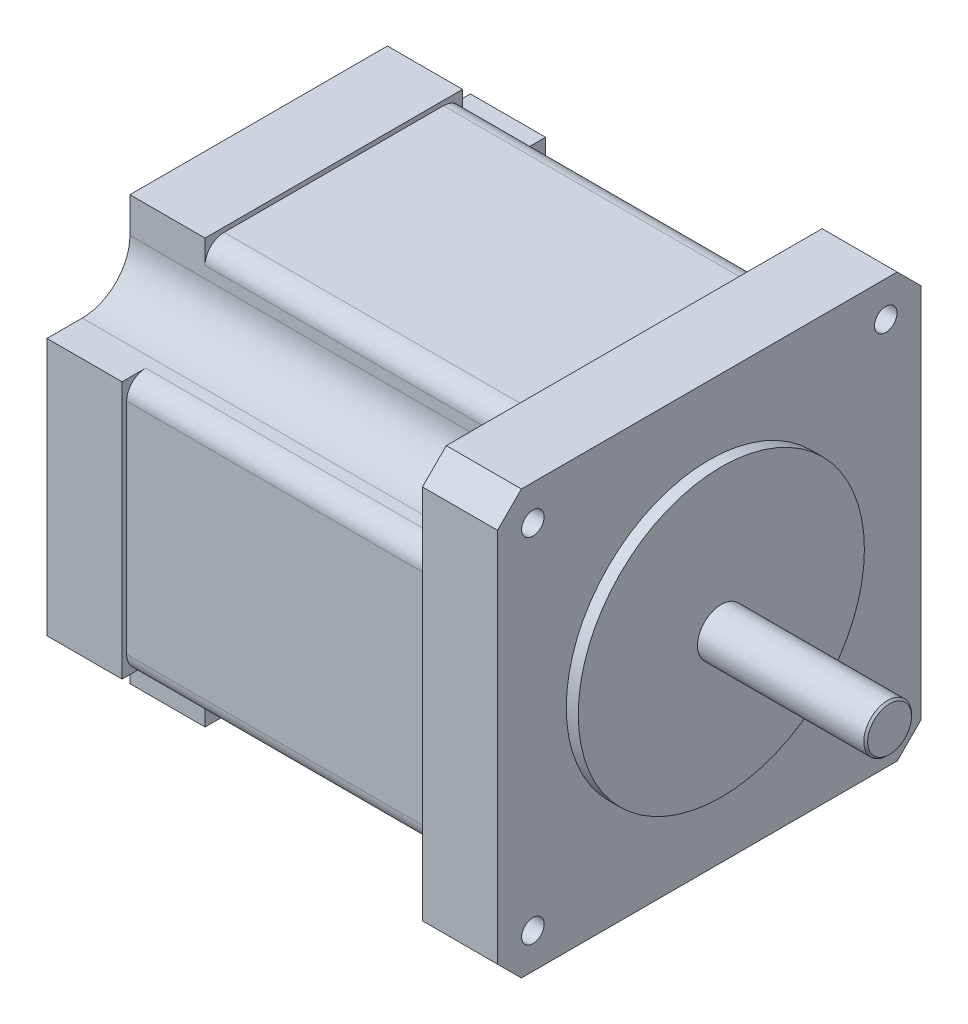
ISO-10303-21;
HEADER;
FILE_DESCRIPTION(('STEP AP214'),'2;1');
FILE_NAME('part.step','',(''),(''),'','','');
FILE_SCHEMA(('AUTOMOTIVE_DESIGN { 1 0 10303 214 1 1 1 1 }'));
ENDSEC;
DATA;
#1=APPLICATION_CONTEXT('core data for automotive mechanical design processes');
#2=APPLICATION_PROTOCOL_DEFINITION('international standard','automotive_design',2000,#1);
#3=PRODUCT_CONTEXT('',#1,'mechanical');
#4=PRODUCT('Part','Part','',(#3));
#5=PRODUCT_RELATED_PRODUCT_CATEGORY('part','',(#4));
#6=PRODUCT_DEFINITION_FORMATION('','',#4);
#7=PRODUCT_DEFINITION_CONTEXT('part definition',#1,'design');
#8=PRODUCT_DEFINITION('design','',#6,#7);
#9=PRODUCT_DEFINITION_SHAPE('','',#8);
#10=(LENGTH_UNIT() NAMED_UNIT(*) SI_UNIT(.MILLI.,.METRE.));
#11=(NAMED_UNIT(*) PLANE_ANGLE_UNIT() SI_UNIT($,.RADIAN.));
#12=(NAMED_UNIT(*) SI_UNIT($,.STERADIAN.) SOLID_ANGLE_UNIT());
#13=UNCERTAINTY_MEASURE_WITH_UNIT(LENGTH_MEASURE(1.E-05),#10,'distance_accuracy_value','');
#14=(GEOMETRIC_REPRESENTATION_CONTEXT(3) GLOBAL_UNCERTAINTY_ASSIGNED_CONTEXT((#13)) GLOBAL_UNIT_ASSIGNED_CONTEXT((#10,
#11,#12)) REPRESENTATION_CONTEXT('',''));
#15=CARTESIAN_POINT('',(0.,0.,0.));
#16=DIRECTION('',(0.,0.,1.));
#17=DIRECTION('',(1.,0.,0.));
#18=AXIS2_PLACEMENT_3D('',#15,#16,#17);
#19=CARTESIAN_POINT('',(10.,28.194,-28.194));
#20=DIRECTION('',(1.,0.,0.));
#21=DIRECTION('',(0.,0.707106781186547,0.707106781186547));
#22=AXIS2_PLACEMENT_3D('',#19,#20,#21);
#23=PLANE('',#22);
#24=DIRECTION('',(0.,-1.,0.));
#25=VECTOR('',#24,1.);
#26=CARTESIAN_POINT('',(10.,28.1940000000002,-45.339));
#27=LINE('',#26,#25);
#28=CARTESIAN_POINT('',(10.,56.3880000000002,-45.3389999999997));
#29=VERTEX_POINT('',#28);
#30=CARTESIAN_POINT('',(10.,53.236195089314,-45.3389999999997));
#31=VERTEX_POINT('',#30);
#32=EDGE_CURVE('E753',#29,#31,#27,.T.);
#33=ORIENTED_EDGE('',*,*,#32,.F.);
#34=DIRECTION('',(0.,0.,1.));
#35=VECTOR('',#34,1.);
#36=CARTESIAN_POINT('',(10.,56.388,0.));
#37=LINE('',#36,#35);
#38=CARTESIAN_POINT('',(10.,56.388,-11.049));
#39=VERTEX_POINT('',#38);
#40=EDGE_CURVE('E693',#29,#39,#37,.T.);
#41=ORIENTED_EDGE('',*,*,#40,.T.);
#42=DIRECTION('',(0.,1.,0.));
#43=VECTOR('',#42,1.);
#44=CARTESIAN_POINT('',(10.,28.194,-11.049));
#45=LINE('',#44,#43);
#46=CARTESIAN_POINT('',(10.,53.236195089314,-11.049));
#47=VERTEX_POINT('',#46);
#48=EDGE_CURVE('E54',#47,#39,#45,.T.);
#49=ORIENTED_EDGE('',*,*,#48,.F.);
#50=CARTESIAN_POINT('',(10.,53.236195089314,-13.589));
#51=DIRECTION('',(1.,0.,0.));
#52=DIRECTION('',(0.,0.,-1.));
#53=AXIS2_PLACEMENT_3D('',#50,#51,#52);
#54=CIRCLE('',#53,2.54);
#55=CARTESIAN_POINT('',(10.,55.776195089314,-13.589));
#56=VERTEX_POINT('',#55);
#57=EDGE_CURVE('E432',#47,#56,#54,.F.);
#58=ORIENTED_EDGE('',*,*,#57,.T.);
#59=DIRECTION('',(0.,0.,-1.));
#60=VECTOR('',#59,1.);
#61=CARTESIAN_POINT('',(10.,55.776195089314,-40.5767910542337));
#62=LINE('',#61,#60);
#63=CARTESIAN_POINT('',(10.,55.776195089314,-42.7989999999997));
#64=VERTEX_POINT('',#63);
#65=EDGE_CURVE('E684',#56,#64,#62,.T.);
#66=ORIENTED_EDGE('',*,*,#65,.T.);
#67=CARTESIAN_POINT('',(10.,53.236195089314,-42.7989999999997));
#68=DIRECTION('',(1.,0.,0.));
#69=DIRECTION('',(0.,0.,-1.));
#70=AXIS2_PLACEMENT_3D('',#67,#68,#69);
#71=CIRCLE('',#70,2.54);
#72=EDGE_CURVE('E406',#64,#31,#71,.F.);
#73=ORIENTED_EDGE('',*,*,#72,.T.);
#74=EDGE_LOOP('',(#33,#41,#49,#58,#66,#73));
#75=FACE_BOUND('',#74,.T.);
#76=ADVANCED_FACE('F39',(#75),#23,.T.);
#77=DIRECTION('',(0.,0.,-1.));
#78=VECTOR('',#77,1.);
#79=CARTESIAN_POINT('',(10.,45.339,-28.1939999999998));
#80=LINE('',#79,#78);
#81=CARTESIAN_POINT('',(10.,45.3390000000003,-53.2361950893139));
#82=VERTEX_POINT('',#81);
#83=CARTESIAN_POINT('',(10.,45.3390000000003,-56.3879999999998));
#84=VERTEX_POINT('',#83);
#85=EDGE_CURVE('E325',#82,#84,#80,.T.);
#86=ORIENTED_EDGE('',*,*,#85,.F.);
#87=CARTESIAN_POINT('',(10.,42.7990000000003,-53.236195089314));
#88=DIRECTION('',(1.,0.,0.));
#89=DIRECTION('',(0.,0.,-1.));
#90=AXIS2_PLACEMENT_3D('',#87,#88,#89);
#91=CIRCLE('',#90,2.54);
#92=CARTESIAN_POINT('',(10.,42.7990000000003,-55.776195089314));
#93=VERTEX_POINT('',#92);
#94=EDGE_CURVE('E400',#82,#93,#91,.F.);
#95=ORIENTED_EDGE('',*,*,#94,.T.);
#96=DIRECTION('',(0.,-1.,0.));
#97=VECTOR('',#96,1.);
#98=CARTESIAN_POINT('',(10.,15.8112089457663,-55.776195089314));
#99=LINE('',#98,#97);
#100=CARTESIAN_POINT('',(10.,13.589,-55.776195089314));
#101=VERTEX_POINT('',#100);
#102=EDGE_CURVE('E643',#93,#101,#99,.T.);
#103=ORIENTED_EDGE('',*,*,#102,.T.);
#104=CARTESIAN_POINT('',(10.,13.589,-53.236195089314));
#105=DIRECTION('',(1.,0.,0.));
#106=DIRECTION('',(0.,0.,-1.));
#107=AXIS2_PLACEMENT_3D('',#104,#105,#106);
#108=CIRCLE('',#107,2.54);
#109=CARTESIAN_POINT('',(10.,11.049,-53.236195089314));
#110=VERTEX_POINT('',#109);
#111=EDGE_CURVE('E411',#101,#110,#108,.F.);
#112=ORIENTED_EDGE('',*,*,#111,.T.);
#113=DIRECTION('',(0.,0.,1.));
#114=VECTOR('',#113,1.);
#115=CARTESIAN_POINT('',(10.,11.049,-28.194));
#116=LINE('',#115,#114);
#117=CARTESIAN_POINT('',(10.,11.049,-56.388));
#118=VERTEX_POINT('',#117);
#119=EDGE_CURVE('E490',#118,#110,#116,.T.);
#120=ORIENTED_EDGE('',*,*,#119,.F.);
#121=DIRECTION('',(0.,1.,0.));
#122=VECTOR('',#121,1.);
#123=CARTESIAN_POINT('',(10.,56.388,-56.388));
#124=LINE('',#123,#122);
#125=EDGE_CURVE('E687',#118,#84,#124,.T.);
#126=ORIENTED_EDGE('',*,*,#125,.T.);
#127=EDGE_LOOP('',(#86,#95,#103,#112,#120,#126));
#128=FACE_BOUND('',#127,.T.);
#129=ADVANCED_FACE('F449',(#128),#23,.T.);
#130=DIRECTION('',(0.,-1.,0.));
#131=VECTOR('',#130,1.);
#132=CARTESIAN_POINT('',(10.,28.194,-45.339));
#133=LINE('',#132,#131);
#134=CARTESIAN_POINT('',(10.,3.15180491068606,-45.339));
#135=VERTEX_POINT('',#134);
#136=CARTESIAN_POINT('',(10.,0.,-45.339));
#137=VERTEX_POINT('',#136);
#138=EDGE_CURVE('E481',#135,#137,#133,.T.);
#139=ORIENTED_EDGE('',*,*,#138,.F.);
#140=CARTESIAN_POINT('',(10.,3.15180491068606,-42.799));
#141=DIRECTION('',(1.,0.,0.));
#142=DIRECTION('',(0.,0.,-1.));
#143=AXIS2_PLACEMENT_3D('',#140,#141,#142);
#144=CIRCLE('',#143,2.54);
#145=CARTESIAN_POINT('',(10.,0.611804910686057,-42.799));
#146=VERTEX_POINT('',#145);
#147=EDGE_CURVE('E414',#135,#146,#144,.F.);
#148=ORIENTED_EDGE('',*,*,#147,.T.);
#149=DIRECTION('',(0.,0.,1.));
#150=VECTOR('',#149,1.);
#151=CARTESIAN_POINT('',(10.,0.611804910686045,-15.8112089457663));
#152=LINE('',#151,#150);
#153=CARTESIAN_POINT('',(10.,0.611804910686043,-13.5890000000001));
#154=VERTEX_POINT('',#153);
#155=EDGE_CURVE('E679',#146,#154,#152,.T.);
#156=ORIENTED_EDGE('',*,*,#155,.T.);
#157=CARTESIAN_POINT('',(10.,3.15180491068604,-13.5890000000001));
#158=DIRECTION('',(1.,0.,0.));
#159=DIRECTION('',(0.,0.,-1.));
#160=AXIS2_PLACEMENT_3D('',#157,#158,#159);
#161=CIRCLE('',#160,2.54);
#162=CARTESIAN_POINT('',(10.,3.15180491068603,-11.0490000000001));
#163=VERTEX_POINT('',#162);
#164=EDGE_CURVE('E420',#154,#163,#161,.F.);
#165=ORIENTED_EDGE('',*,*,#164,.T.);
#166=DIRECTION('',(0.,1.,0.));
#167=VECTOR('',#166,1.);
#168=CARTESIAN_POINT('',(10.,28.1939999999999,-11.049));
#169=LINE('',#168,#167);
#170=CARTESIAN_POINT('',(10.,0.,-11.0490000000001));
#171=VERTEX_POINT('',#170);
#172=EDGE_CURVE('E549',#171,#163,#169,.T.);
#173=ORIENTED_EDGE('',*,*,#172,.F.);
#174=DIRECTION('',(0.,0.,-1.));
#175=VECTOR('',#174,1.);
#176=CARTESIAN_POINT('',(10.,0.,-56.388));
#177=LINE('',#176,#175);
#178=EDGE_CURVE('E487',#171,#137,#177,.T.);
#179=ORIENTED_EDGE('',*,*,#178,.T.);
#180=EDGE_LOOP('',(#139,#148,#156,#165,#173,#179));
#181=FACE_BOUND('',#180,.T.);
#182=ADVANCED_FACE('F455',(#181),#23,.T.);
#183=CARTESIAN_POINT('',(60.,4.69899999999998,-51.689));
#184=DIRECTION('',(-1.,0.,0.));
#185=DIRECTION('',(0.,0.,1.));
#186=AXIS2_PLACEMENT_3D('',#183,#184,#185);
#187=CYLINDRICAL_SURFACE('',#186,1.5);
#188=CARTESIAN_POINT('',(50.,4.69899999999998,-51.689));
#189=DIRECTION('',(1.,0.,0.));
#190=DIRECTION('',(0.,0.,-1.));
#191=AXIS2_PLACEMENT_3D('',#188,#189,#190);
#192=CIRCLE('',#191,1.5);
#193=CARTESIAN_POINT('',(50.,4.69899999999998,-53.189));
#194=VERTEX_POINT('',#193);
#195=EDGE_CURVE('E518',#194,#194,#192,.F.);
#196=ORIENTED_EDGE('',*,*,#195,.T.);
#197=EDGE_LOOP('',(#196));
#198=FACE_BOUND('',#197,.T.);
#199=CARTESIAN_POINT('',(60.,4.69899999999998,-51.689));
#200=DIRECTION('',(-1.,0.,0.));
#201=DIRECTION('',(0.,0.,1.));
#202=AXIS2_PLACEMENT_3D('',#199,#200,#201);
#203=CIRCLE('',#202,1.5);
#204=CARTESIAN_POINT('',(60.,4.69899999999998,-53.189));
#205=VERTEX_POINT('',#204);
#206=EDGE_CURVE('E582',#205,#205,#203,.T.);
#207=ORIENTED_EDGE('',*,*,#206,.F.);
#208=EDGE_LOOP('',(#207));
#209=FACE_BOUND('',#208,.T.);
#210=ADVANCED_FACE('F472',(#198,#209),#187,.F.);
#211=CARTESIAN_POINT('',(60.,51.689,-4.699));
#212=DIRECTION('',(-1.,0.,0.));
#213=DIRECTION('',(0.,0.,1.));
#214=AXIS2_PLACEMENT_3D('',#211,#212,#213);
#215=CYLINDRICAL_SURFACE('',#214,1.5);
#216=CARTESIAN_POINT('',(50.,51.689,-4.699));
#217=DIRECTION('',(1.,0.,0.));
#218=DIRECTION('',(0.,0.,-1.));
#219=AXIS2_PLACEMENT_3D('',#216,#217,#218);
#220=CIRCLE('',#219,1.5);
#221=CARTESIAN_POINT('',(50.,51.689,-6.199));
#222=VERTEX_POINT('',#221);
#223=EDGE_CURVE('E350',#222,#222,#220,.F.);
#224=ORIENTED_EDGE('',*,*,#223,.T.);
#225=EDGE_LOOP('',(#224));
#226=FACE_BOUND('',#225,.T.);
#227=CARTESIAN_POINT('',(60.,51.689,-4.699));
#228=DIRECTION('',(-1.,0.,0.));
#229=DIRECTION('',(0.,0.,1.));
#230=AXIS2_PLACEMENT_3D('',#227,#228,#229);
#231=CIRCLE('',#230,1.5);
#232=CARTESIAN_POINT('',(60.,51.689,-6.199));
#233=VERTEX_POINT('',#232);
#234=EDGE_CURVE('E586',#233,#233,#231,.T.);
#235=ORIENTED_EDGE('',*,*,#234,.F.);
#236=EDGE_LOOP('',(#235));
#237=FACE_BOUND('',#236,.T.);
#238=ADVANCED_FACE('F477',(#226,#237),#215,.F.);
#239=CARTESIAN_POINT('',(60.,51.689,-51.689));
#240=DIRECTION('',(-1.,0.,0.));
#241=DIRECTION('',(0.,0.,1.));
#242=AXIS2_PLACEMENT_3D('',#239,#240,#241);
#243=CYLINDRICAL_SURFACE('',#242,1.5);
#244=CARTESIAN_POINT('',(50.,51.689,-51.689));
#245=DIRECTION('',(1.,0.,0.));
#246=DIRECTION('',(0.,0.,-1.));
#247=AXIS2_PLACEMENT_3D('',#244,#245,#246);
#248=CIRCLE('',#247,1.5);
#249=CARTESIAN_POINT('',(50.,51.689,-53.189));
#250=VERTEX_POINT('',#249);
#251=EDGE_CURVE('E755',#250,#250,#248,.F.);
#252=ORIENTED_EDGE('',*,*,#251,.T.);
#253=EDGE_LOOP('',(#252));
#254=FACE_BOUND('',#253,.T.);
#255=CARTESIAN_POINT('',(60.,51.689,-51.689));
#256=DIRECTION('',(-1.,0.,0.));
#257=DIRECTION('',(0.,0.,1.));
#258=AXIS2_PLACEMENT_3D('',#255,#256,#257);
#259=CIRCLE('',#258,1.5);
#260=CARTESIAN_POINT('',(60.,51.689,-53.189));
#261=VERTEX_POINT('',#260);
#262=EDGE_CURVE('E589',#261,#261,#259,.T.);
#263=ORIENTED_EDGE('',*,*,#262,.F.);
#264=EDGE_LOOP('',(#263));
#265=FACE_BOUND('',#264,.T.);
#266=ADVANCED_FACE('F819',(#254,#265),#243,.F.);
#267=CARTESIAN_POINT('',(60.,4.69899999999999,-4.699));
#268=DIRECTION('',(-1.,0.,0.));
#269=DIRECTION('',(0.,0.,1.));
#270=AXIS2_PLACEMENT_3D('',#267,#268,#269);
#271=CYLINDRICAL_SURFACE('',#270,1.5);
#272=CARTESIAN_POINT('',(50.,4.69899999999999,-4.699));
#273=DIRECTION('',(1.,0.,0.));
#274=DIRECTION('',(0.,0.,-1.));
#275=AXIS2_PLACEMENT_3D('',#272,#273,#274);
#276=CIRCLE('',#275,1.5);
#277=CARTESIAN_POINT('',(50.,4.69899999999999,-6.199));
#278=VERTEX_POINT('',#277);
#279=EDGE_CURVE('E551',#278,#278,#276,.F.);
#280=ORIENTED_EDGE('',*,*,#279,.T.);
#281=EDGE_LOOP('',(#280));
#282=FACE_BOUND('',#281,.T.);
#283=CARTESIAN_POINT('',(60.,4.69899999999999,-4.699));
#284=DIRECTION('',(-1.,0.,0.));
#285=DIRECTION('',(0.,0.,1.));
#286=AXIS2_PLACEMENT_3D('',#283,#284,#285);
#287=CIRCLE('',#286,1.5);
#288=CARTESIAN_POINT('',(60.,4.69899999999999,-6.199));
#289=VERTEX_POINT('',#288);
#290=EDGE_CURVE('E592',#289,#289,#287,.T.);
#291=ORIENTED_EDGE('',*,*,#290,.F.);
#292=EDGE_LOOP('',(#291));
#293=FACE_BOUND('',#292,.T.);
#294=ADVANCED_FACE('F823',(#282,#293),#271,.F.);
#295=CARTESIAN_POINT('',(60.,28.194,-28.194));
#296=DIRECTION('',(1.,0.,0.));
#297=DIRECTION('',(0.,0.,1.));
#298=AXIS2_PLACEMENT_3D('',#295,#296,#297);
#299=CYLINDRICAL_SURFACE('',#298,3.175);
#300=CARTESIAN_POINT('',(83.746,28.194,-28.194));
#301=DIRECTION('',(1.,0.,0.));
#302=DIRECTION('',(0.,0.,-1.));
#303=AXIS2_PLACEMENT_3D('',#300,#301,#302);
#304=CIRCLE('',#303,3.175);
#305=CARTESIAN_POINT('',(83.746,28.194,-31.369));
#306=VERTEX_POINT('',#305);
#307=EDGE_CURVE('E11',#306,#306,#304,.F.);
#308=ORIENTED_EDGE('',*,*,#307,.T.);
#309=EDGE_LOOP('',(#308));
#310=FACE_BOUND('',#309,.T.);
#311=CARTESIAN_POINT('',(61.6002,28.194,-28.194));
#312=DIRECTION('',(-1.,0.,0.));
#313=DIRECTION('',(0.,0.,1.));
#314=AXIS2_PLACEMENT_3D('',#311,#312,#313);
#315=CIRCLE('',#314,3.175);
#316=CARTESIAN_POINT('',(61.6002,28.194,-31.369));
#317=VERTEX_POINT('',#316);
#318=EDGE_CURVE('E363',#317,#317,#315,.T.);
#319=ORIENTED_EDGE('',*,*,#318,.F.);
#320=EDGE_LOOP('',(#319));
#321=FACE_BOUND('',#320,.T.);
#322=ADVANCED_FACE('F827',(#310,#321),#299,.T.);
#323=CARTESIAN_POINT('',(84.,28.194,-28.194));
#324=DIRECTION('',(1.,0.,0.));
#325=DIRECTION('',(0.,0.707106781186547,0.707106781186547));
#326=AXIS2_PLACEMENT_3D('',#323,#324,#325);
#327=PLANE('',#326);
#328=CARTESIAN_POINT('',(84.,28.194,-28.194));
#329=DIRECTION('',(1.,0.,0.));
#330=DIRECTION('',(0.,0.,-1.));
#331=AXIS2_PLACEMENT_3D('',#328,#329,#330);
#332=CIRCLE('',#331,2.92099999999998);
#333=CARTESIAN_POINT('',(84.,28.194,-31.115));
#334=VERTEX_POINT('',#333);
#335=EDGE_CURVE('E47',#334,#334,#332,.T.);
#336=ORIENTED_EDGE('',*,*,#335,.T.);
#337=EDGE_LOOP('',(#336));
#338=FACE_BOUND('',#337,.T.);
#339=ADVANCED_FACE('F437',(#338),#327,.T.);
#340=CARTESIAN_POINT('',(60.,28.194,-28.194));
#341=DIRECTION('',(1.,0.,0.));
#342=DIRECTION('',(0.,0.,1.));
#343=AXIS2_PLACEMENT_3D('',#340,#341,#342);
#344=CYLINDRICAL_SURFACE('',#343,19.05);
#345=CARTESIAN_POINT('',(61.6002,28.194,-28.194));
#346=DIRECTION('',(1.,0.,0.));
#347=DIRECTION('',(0.,0.,1.));
#348=AXIS2_PLACEMENT_3D('',#345,#346,#347);
#349=CIRCLE('',#348,19.05);
#350=CARTESIAN_POINT('',(61.6002,28.194,-47.244));
#351=VERTEX_POINT('',#350);
#352=EDGE_CURVE('E598',#351,#351,#349,.T.);
#353=ORIENTED_EDGE('',*,*,#352,.F.);
#354=EDGE_LOOP('',(#353));
#355=FACE_BOUND('',#354,.T.);
#356=CARTESIAN_POINT('',(60.,28.194,-28.194));
#357=DIRECTION('',(-1.,0.,0.));
#358=DIRECTION('',(0.,0.,1.));
#359=AXIS2_PLACEMENT_3D('',#356,#357,#358);
#360=CIRCLE('',#359,19.05);
#361=CARTESIAN_POINT('',(60.,28.194,-47.244));
#362=VERTEX_POINT('',#361);
#363=EDGE_CURVE('E595',#362,#362,#360,.T.);
#364=ORIENTED_EDGE('',*,*,#363,.F.);
#365=EDGE_LOOP('',(#364));
#366=FACE_BOUND('',#365,.T.);
#367=ADVANCED_FACE('F834',(#355,#366),#344,.T.);
#368=CARTESIAN_POINT('',(61.6002,28.194,-28.194));
#369=DIRECTION('',(1.,0.,0.));
#370=DIRECTION('',(0.,0.707106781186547,0.707106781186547));
#371=AXIS2_PLACEMENT_3D('',#368,#369,#370);
#372=PLANE('',#371);
#373=ORIENTED_EDGE('',*,*,#318,.T.);
#374=EDGE_LOOP('',(#373));
#375=FACE_BOUND('',#374,.T.);
#376=ORIENTED_EDGE('',*,*,#352,.T.);
#377=EDGE_LOOP('',(#376));
#378=FACE_BOUND('',#377,.T.);
#379=ADVANCED_FACE('F837',(#375,#378),#372,.T.);
#380=CARTESIAN_POINT('',(50.,28.194,-28.194));
#381=DIRECTION('',(1.,0.,0.));
#382=DIRECTION('',(0.,0.707106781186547,0.707106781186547));
#383=AXIS2_PLACEMENT_3D('',#380,#381,#382);
#384=PLANE('',#383);
#385=DIRECTION('',(0.,1.,0.));
#386=VECTOR('',#385,1.);
#387=CARTESIAN_POINT('',(50.,51.6890000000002,-45.3389999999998));
#388=LINE('',#387,#386);
#389=CARTESIAN_POINT('',(50.,51.6890000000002,-45.3389999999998));
#390=VERTEX_POINT('',#389);
#391=CARTESIAN_POINT('',(50.,53.236195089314,-45.3389999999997));
#392=VERTEX_POINT('',#391);
#393=EDGE_CURVE('E343',#390,#392,#388,.T.);
#394=ORIENTED_EDGE('',*,*,#393,.T.);
#395=CARTESIAN_POINT('',(50.,53.236195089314,-42.7989999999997));
#396=DIRECTION('',(1.,0.,0.));
#397=DIRECTION('',(0.,0.,-1.));
#398=AXIS2_PLACEMENT_3D('',#395,#396,#397);
#399=CIRCLE('',#398,2.54);
#400=CARTESIAN_POINT('',(50.,55.776195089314,-42.7989999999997));
#401=VERTEX_POINT('',#400);
#402=EDGE_CURVE('E404',#392,#401,#399,.T.);
#403=ORIENTED_EDGE('',*,*,#402,.T.);
#404=DIRECTION('',(0.,0.,1.));
#405=VECTOR('',#404,1.);
#406=CARTESIAN_POINT('',(50.,55.776195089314,-3.42841789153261));
#407=LINE('',#406,#405);
#408=CARTESIAN_POINT('',(50.,55.776195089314,-13.589));
#409=VERTEX_POINT('',#408);
#410=EDGE_CURVE('E601',#401,#409,#407,.T.);
#411=ORIENTED_EDGE('',*,*,#410,.T.);
#412=CARTESIAN_POINT('',(50.,53.236195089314,-13.589));
#413=DIRECTION('',(1.,0.,0.));
#414=DIRECTION('',(0.,0.,-1.));
#415=AXIS2_PLACEMENT_3D('',#412,#413,#414);
#416=CIRCLE('',#415,2.54);
#417=CARTESIAN_POINT('',(50.,53.236195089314,-11.049));
#418=VERTEX_POINT('',#417);
#419=EDGE_CURVE('E62',#409,#418,#416,.T.);
#420=ORIENTED_EDGE('',*,*,#419,.T.);
#421=DIRECTION('',(0.,-1.,0.));
#422=VECTOR('',#421,1.);
#423=CARTESIAN_POINT('',(50.,51.689,-11.049));
#424=LINE('',#423,#422);
#425=CARTESIAN_POINT('',(50.,51.689,-11.049));
#426=VERTEX_POINT('',#425);
#427=EDGE_CURVE('E571',#418,#426,#424,.T.);
#428=ORIENTED_EDGE('',*,*,#427,.T.);
#429=CARTESIAN_POINT('',(50.,51.689,-4.699));
#430=DIRECTION('',(1.,0.,0.));
#431=DIRECTION('',(0.,0.,-1.));
#432=AXIS2_PLACEMENT_3D('',#429,#430,#431);
#433=CIRCLE('',#432,6.35);
#434=CARTESIAN_POINT('',(50.,45.339,-4.699));
#435=VERTEX_POINT('',#434);
#436=EDGE_CURVE('E566',#426,#435,#433,.F.);
#437=ORIENTED_EDGE('',*,*,#436,.T.);
#438=DIRECTION('',(0.,0.,1.));
#439=VECTOR('',#438,1.);
#440=CARTESIAN_POINT('',(50.,45.339,-4.699));
#441=LINE('',#440,#439);
#442=CARTESIAN_POINT('',(50.,45.339,-3.15180491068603));
#443=VERTEX_POINT('',#442);
#444=EDGE_CURVE('E557',#435,#443,#441,.T.);
#445=ORIENTED_EDGE('',*,*,#444,.T.);
#446=CARTESIAN_POINT('',(50.,42.799,-3.15180491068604));
#447=DIRECTION('',(1.,0.,0.));
#448=DIRECTION('',(0.,0.,-1.));
#449=AXIS2_PLACEMENT_3D('',#446,#447,#448);
#450=CIRCLE('',#449,2.54);
#451=CARTESIAN_POINT('',(50.,42.799,-0.611804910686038));
#452=VERTEX_POINT('',#451);
#453=EDGE_CURVE('E427',#443,#452,#450,.T.);
#454=ORIENTED_EDGE('',*,*,#453,.T.);
#455=DIRECTION('',(0.,-1.,0.));
#456=VECTOR('',#455,1.);
#457=CARTESIAN_POINT('',(50.,3.42841789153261,-0.611804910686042));
#458=LINE('',#457,#456);
#459=CARTESIAN_POINT('',(50.,13.5889999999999,-0.611804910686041));
#460=VERTEX_POINT('',#459);
#461=EDGE_CURVE('E630',#452,#460,#458,.T.);
#462=ORIENTED_EDGE('',*,*,#461,.T.);
#463=CARTESIAN_POINT('',(50.,13.5889999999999,-3.15180491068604));
#464=DIRECTION('',(1.,0.,0.));
#465=DIRECTION('',(0.,0.,-1.));
#466=AXIS2_PLACEMENT_3D('',#463,#464,#465);
#467=CIRCLE('',#466,2.54);
#468=CARTESIAN_POINT('',(50.,11.0489999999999,-3.15180491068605));
#469=VERTEX_POINT('',#468);
#470=EDGE_CURVE('E425',#460,#469,#467,.T.);
#471=ORIENTED_EDGE('',*,*,#470,.T.);
#472=DIRECTION('',(0.,0.,-1.));
#473=VECTOR('',#472,1.);
#474=CARTESIAN_POINT('',(50.,11.0489999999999,-4.69900000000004));
#475=LINE('',#474,#473);
#476=CARTESIAN_POINT('',(50.,11.0489999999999,-4.69900000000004));
#477=VERTEX_POINT('',#476);
#478=EDGE_CURVE('E538',#469,#477,#475,.T.);
#479=ORIENTED_EDGE('',*,*,#478,.T.);
#480=CARTESIAN_POINT('',(50.,4.69899999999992,-4.69900000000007));
#481=DIRECTION('',(1.,0.,0.));
#482=DIRECTION('',(0.,0.,-1.));
#483=AXIS2_PLACEMENT_3D('',#480,#481,#482);
#484=CIRCLE('',#483,6.35);
#485=CARTESIAN_POINT('',(50.,4.69899999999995,-11.0490000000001));
#486=VERTEX_POINT('',#485);
#487=EDGE_CURVE('E533',#477,#486,#484,.F.);
#488=ORIENTED_EDGE('',*,*,#487,.T.);
#489=DIRECTION('',(0.,-1.,0.));
#490=VECTOR('',#489,1.);
#491=CARTESIAN_POINT('',(50.,4.69899999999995,-11.0490000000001));
#492=LINE('',#491,#490);
#493=CARTESIAN_POINT('',(50.,3.15180491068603,-11.0490000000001));
#494=VERTEX_POINT('',#493);
#495=EDGE_CURVE('E524',#486,#494,#492,.T.);
#496=ORIENTED_EDGE('',*,*,#495,.T.);
#497=CARTESIAN_POINT('',(50.,3.15180491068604,-13.5890000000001));
#498=DIRECTION('',(1.,0.,0.));
#499=DIRECTION('',(0.,0.,-1.));
#500=AXIS2_PLACEMENT_3D('',#497,#498,#499);
#501=CIRCLE('',#500,2.54);
#502=CARTESIAN_POINT('',(50.,0.611804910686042,-13.5890000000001));
#503=VERTEX_POINT('',#502);
#504=EDGE_CURVE('E418',#494,#503,#501,.T.);
#505=ORIENTED_EDGE('',*,*,#504,.T.);
#506=DIRECTION('',(0.,0.,-1.));
#507=VECTOR('',#506,1.);
#508=CARTESIAN_POINT('',(50.,0.611804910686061,-52.9595821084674));
#509=LINE('',#508,#507);
#510=CARTESIAN_POINT('',(50.,0.611804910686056,-42.799));
#511=VERTEX_POINT('',#510);
#512=EDGE_CURVE('E633',#503,#511,#509,.T.);
#513=ORIENTED_EDGE('',*,*,#512,.T.);
#514=CARTESIAN_POINT('',(50.,3.15180491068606,-42.799));
#515=DIRECTION('',(1.,0.,0.));
#516=DIRECTION('',(0.,0.,-1.));
#517=AXIS2_PLACEMENT_3D('',#514,#515,#516);
#518=CIRCLE('',#517,2.54);
#519=CARTESIAN_POINT('',(50.,3.15180491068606,-45.339));
#520=VERTEX_POINT('',#519);
#521=EDGE_CURVE('E416',#511,#520,#518,.T.);
#522=ORIENTED_EDGE('',*,*,#521,.T.);
#523=DIRECTION('',(0.,1.,0.));
#524=VECTOR('',#523,1.);
#525=CARTESIAN_POINT('',(50.,4.69899999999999,-45.339));
#526=LINE('',#525,#524);
#527=CARTESIAN_POINT('',(50.,4.69899999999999,-45.339));
#528=VERTEX_POINT('',#527);
#529=EDGE_CURVE('E501',#520,#528,#526,.T.);
#530=ORIENTED_EDGE('',*,*,#529,.T.);
#531=CARTESIAN_POINT('',(50.,4.69899999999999,-51.689));
#532=DIRECTION('',(1.,0.,0.));
#533=DIRECTION('',(0.,0.,-1.));
#534=AXIS2_PLACEMENT_3D('',#531,#532,#533);
#535=CIRCLE('',#534,6.35);
#536=CARTESIAN_POINT('',(50.,11.049,-51.689));
#537=VERTEX_POINT('',#536);
#538=EDGE_CURVE('E508',#528,#537,#535,.F.);
#539=ORIENTED_EDGE('',*,*,#538,.T.);
#540=DIRECTION('',(0.,0.,-1.));
#541=VECTOR('',#540,1.);
#542=CARTESIAN_POINT('',(50.,11.049,-51.689));
#543=LINE('',#542,#541);
#544=CARTESIAN_POINT('',(50.,11.049,-53.236195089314));
#545=VERTEX_POINT('',#544);
#546=EDGE_CURVE('E515',#537,#545,#543,.T.);
#547=ORIENTED_EDGE('',*,*,#546,.T.);
#548=CARTESIAN_POINT('',(50.,13.589,-53.236195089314));
#549=DIRECTION('',(1.,0.,0.));
#550=DIRECTION('',(0.,0.,-1.));
#551=AXIS2_PLACEMENT_3D('',#548,#549,#550);
#552=CIRCLE('',#551,2.54);
#553=CARTESIAN_POINT('',(50.,13.589,-55.776195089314));
#554=VERTEX_POINT('',#553);
#555=EDGE_CURVE('E409',#545,#554,#552,.T.);
#556=ORIENTED_EDGE('',*,*,#555,.T.);
#557=DIRECTION('',(0.,1.,0.));
#558=VECTOR('',#557,1.);
#559=CARTESIAN_POINT('',(50.,52.9595821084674,-55.776195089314));
#560=LINE('',#559,#558);
#561=CARTESIAN_POINT('',(50.,42.7990000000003,-55.776195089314));
#562=VERTEX_POINT('',#561);
#563=EDGE_CURVE('E610',#554,#562,#560,.T.);
#564=ORIENTED_EDGE('',*,*,#563,.T.);
#565=CARTESIAN_POINT('',(50.,42.7990000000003,-53.236195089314));
#566=DIRECTION('',(1.,0.,0.));
#567=DIRECTION('',(0.,0.,-1.));
#568=AXIS2_PLACEMENT_3D('',#565,#566,#567);
#569=CIRCLE('',#568,2.54);
#570=CARTESIAN_POINT('',(50.,45.3390000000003,-53.2361950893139));
#571=VERTEX_POINT('',#570);
#572=EDGE_CURVE('E402',#562,#571,#569,.T.);
#573=ORIENTED_EDGE('',*,*,#572,.T.);
#574=DIRECTION('',(0.,0.,1.));
#575=VECTOR('',#574,1.);
#576=CARTESIAN_POINT('',(50.,45.3390000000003,-51.6889999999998));
#577=LINE('',#576,#575);
#578=CARTESIAN_POINT('',(50.,45.3390000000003,-51.6889999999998));
#579=VERTEX_POINT('',#578);
#580=EDGE_CURVE('E330',#571,#579,#577,.T.);
#581=ORIENTED_EDGE('',*,*,#580,.T.);
#582=CARTESIAN_POINT('',(50.,51.6890000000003,-51.6889999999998));
#583=DIRECTION('',(1.,0.,0.));
#584=DIRECTION('',(0.,0.,-1.));
#585=AXIS2_PLACEMENT_3D('',#582,#583,#584);
#586=CIRCLE('',#585,6.35);
#587=EDGE_CURVE('E751',#579,#390,#586,.F.);
#588=ORIENTED_EDGE('',*,*,#587,.T.);
#589=EDGE_LOOP('',(#394,#403,#411,#420,#428,#437,#445,#454,#462,#471,#479,#488,#496,#505,#513,
#522,#530,#539,#547,#556,#564,#573,#581,#588));
#590=FACE_BOUND('',#589,.T.);
#591=DIRECTION('',(0.,-0.707106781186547,0.707106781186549));
#592=VECTOR('',#591,1.);
#593=CARTESIAN_POINT('',(50.,56.388,-3.175));
#594=LINE('',#593,#592);
#595=CARTESIAN_POINT('',(50.,56.388,-3.175));
#596=VERTEX_POINT('',#595);
#597=CARTESIAN_POINT('',(50.,53.213,0.));
#598=VERTEX_POINT('',#597);
#599=EDGE_CURVE('E618',#596,#598,#594,.T.);
#600=ORIENTED_EDGE('',*,*,#599,.F.);
#601=DIRECTION('',(0.,0.,1.));
#602=VECTOR('',#601,1.);
#603=CARTESIAN_POINT('',(50.,56.388,-53.213));
#604=LINE('',#603,#602);
#605=CARTESIAN_POINT('',(50.,56.388,-53.213));
#606=VERTEX_POINT('',#605);
#607=EDGE_CURVE('E621',#606,#596,#604,.T.);
#608=ORIENTED_EDGE('',*,*,#607,.F.);
#609=DIRECTION('',(0.,0.707106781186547,0.707106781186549));
#610=VECTOR('',#609,1.);
#611=CARTESIAN_POINT('',(50.,53.213,-56.388));
#612=LINE('',#611,#610);
#613=CARTESIAN_POINT('',(50.,53.213,-56.388));
#614=VERTEX_POINT('',#613);
#615=EDGE_CURVE('E624',#614,#606,#612,.T.);
#616=ORIENTED_EDGE('',*,*,#615,.F.);
#617=DIRECTION('',(0.,1.,0.));
#618=VECTOR('',#617,1.);
#619=CARTESIAN_POINT('',(50.,3.17500000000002,-56.388));
#620=LINE('',#619,#618);
#621=CARTESIAN_POINT('',(50.,3.17500000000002,-56.388));
#622=VERTEX_POINT('',#621);
#623=EDGE_CURVE('E627',#622,#614,#620,.T.);
#624=ORIENTED_EDGE('',*,*,#623,.F.);
#625=DIRECTION('',(0.,0.707106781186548,-0.707106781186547));
#626=VECTOR('',#625,1.);
#627=CARTESIAN_POINT('',(50.,0.,-53.213));
#628=LINE('',#627,#626);
#629=CARTESIAN_POINT('',(50.,0.,-53.213));
#630=VERTEX_POINT('',#629);
#631=EDGE_CURVE('E605',#630,#622,#628,.T.);
#632=ORIENTED_EDGE('',*,*,#631,.F.);
#633=DIRECTION('',(0.,0.,-1.));
#634=VECTOR('',#633,1.);
#635=CARTESIAN_POINT('',(50.,0.,-3.175));
#636=LINE('',#635,#634);
#637=CARTESIAN_POINT('',(50.,0.,-3.175));
#638=VERTEX_POINT('',#637);
#639=EDGE_CURVE('E608',#638,#630,#636,.T.);
#640=ORIENTED_EDGE('',*,*,#639,.F.);
#641=DIRECTION('',(0.,-0.707106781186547,-0.707106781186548));
#642=VECTOR('',#641,1.);
#643=CARTESIAN_POINT('',(50.,3.175,0.));
#644=LINE('',#643,#642);
#645=CARTESIAN_POINT('',(50.,3.175,0.));
#646=VERTEX_POINT('',#645);
#647=EDGE_CURVE('E612',#646,#638,#644,.T.);
#648=ORIENTED_EDGE('',*,*,#647,.F.);
#649=DIRECTION('',(0.,-1.,0.));
#650=VECTOR('',#649,1.);
#651=CARTESIAN_POINT('',(50.,53.213,0.));
#652=LINE('',#651,#650);
#653=EDGE_CURVE('E615',#598,#646,#652,.T.);
#654=ORIENTED_EDGE('',*,*,#653,.F.);
#655=EDGE_LOOP('',(#600,#608,#616,#624,#632,#640,#648,#654));
#656=FACE_BOUND('',#655,.T.);
#657=ORIENTED_EDGE('',*,*,#223,.F.);
#658=EDGE_LOOP('',(#657));
#659=FACE_BOUND('',#658,.T.);
#660=ORIENTED_EDGE('',*,*,#279,.F.);
#661=EDGE_LOOP('',(#660));
#662=FACE_BOUND('',#661,.T.);
#663=ORIENTED_EDGE('',*,*,#195,.F.);
#664=EDGE_LOOP('',(#663));
#665=FACE_BOUND('',#664,.T.);
#666=ORIENTED_EDGE('',*,*,#251,.F.);
#667=EDGE_LOOP('',(#666));
#668=FACE_BOUND('',#667,.T.);
#669=ADVANCED_FACE('F728',(#590,#656,#659,#662,#665,#668),#384,.F.);
#670=CARTESIAN_POINT('',(50.,0.,-3.175));
#671=DIRECTION('',(0.,-1.,0.));
#672=DIRECTION('',(0.707106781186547,0.,0.707106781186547));
#673=AXIS2_PLACEMENT_3D('',#670,#671,#672);
#674=PLANE('',#673);
#675=ORIENTED_EDGE('',*,*,#639,.T.);
#676=DIRECTION('',(1.,0.,0.));
#677=VECTOR('',#676,1.);
#678=CARTESIAN_POINT('',(50.,0.,-53.213));
#679=LINE('',#678,#677);
#680=CARTESIAN_POINT('',(60.,0.,-53.213));
#681=VERTEX_POINT('',#680);
#682=EDGE_CURVE('E611',#630,#681,#679,.T.);
#683=ORIENTED_EDGE('',*,*,#682,.T.);
#684=DIRECTION('',(0.,0.,-1.));
#685=VECTOR('',#684,1.);
#686=CARTESIAN_POINT('',(60.,0.,-3.175));
#687=LINE('',#686,#685);
#688=CARTESIAN_POINT('',(60.,0.,-3.175));
#689=VERTEX_POINT('',#688);
#690=EDGE_CURVE('E640',#689,#681,#687,.T.);
#691=ORIENTED_EDGE('',*,*,#690,.F.);
#692=DIRECTION('',(1.,0.,0.));
#693=VECTOR('',#692,1.);
#694=CARTESIAN_POINT('',(50.,0.,-3.175));
#695=LINE('',#694,#693);
#696=EDGE_CURVE('E614',#638,#689,#695,.T.);
#697=ORIENTED_EDGE('',*,*,#696,.F.);
#698=EDGE_LOOP('',(#675,#683,#691,#697));
#699=FACE_BOUND('',#698,.T.);
#700=ADVANCED_FACE('F844',(#699),#674,.T.);
#701=CARTESIAN_POINT('',(50.,3.175,0.));
#702=DIRECTION('',(0.,-0.707106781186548,0.707106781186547));
#703=DIRECTION('',(0.577350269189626,0.577350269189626,0.577350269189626));
#704=AXIS2_PLACEMENT_3D('',#701,#702,#703);
#705=PLANE('',#704);
#706=ORIENTED_EDGE('',*,*,#647,.T.);
#707=ORIENTED_EDGE('',*,*,#696,.T.);
#708=DIRECTION('',(0.,-0.707106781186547,-0.707106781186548));
#709=VECTOR('',#708,1.);
#710=CARTESIAN_POINT('',(60.,3.175,0.));
#711=LINE('',#710,#709);
#712=CARTESIAN_POINT('',(60.,3.175,0.));
#713=VERTEX_POINT('',#712);
#714=EDGE_CURVE('E642',#713,#689,#711,.T.);
#715=ORIENTED_EDGE('',*,*,#714,.F.);
#716=DIRECTION('',(1.,0.,0.));
#717=VECTOR('',#716,1.);
#718=CARTESIAN_POINT('',(50.,3.175,0.));
#719=LINE('',#718,#717);
#720=EDGE_CURVE('E617',#646,#713,#719,.T.);
#721=ORIENTED_EDGE('',*,*,#720,.F.);
#722=EDGE_LOOP('',(#706,#707,#715,#721));
#723=FACE_BOUND('',#722,.T.);
#724=ADVANCED_FACE('F847',(#723),#705,.T.);
#725=CARTESIAN_POINT('',(50.,53.213,0.));
#726=DIRECTION('',(0.,0.,1.));
#727=DIRECTION('',(0.707106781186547,0.707106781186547,0.));
#728=AXIS2_PLACEMENT_3D('',#725,#726,#727);
#729=PLANE('',#728);
#730=ORIENTED_EDGE('',*,*,#653,.T.);
#731=ORIENTED_EDGE('',*,*,#720,.T.);
#732=DIRECTION('',(0.,-1.,0.));
#733=VECTOR('',#732,1.);
#734=CARTESIAN_POINT('',(60.,53.213,0.));
#735=LINE('',#734,#733);
#736=CARTESIAN_POINT('',(60.,53.213,0.));
#737=VERTEX_POINT('',#736);
#738=EDGE_CURVE('E648',#737,#713,#735,.T.);
#739=ORIENTED_EDGE('',*,*,#738,.F.);
#740=DIRECTION('',(1.,0.,0.));
#741=VECTOR('',#740,1.);
#742=CARTESIAN_POINT('',(50.,53.213,0.));
#743=LINE('',#742,#741);
#744=EDGE_CURVE('E620',#598,#737,#743,.T.);
#745=ORIENTED_EDGE('',*,*,#744,.F.);
#746=EDGE_LOOP('',(#730,#731,#739,#745));
#747=FACE_BOUND('',#746,.T.);
#748=ADVANCED_FACE('F851',(#747),#729,.T.);
#749=CARTESIAN_POINT('',(50.,56.388,-3.175));
#750=DIRECTION('',(0.,0.707106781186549,0.707106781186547));
#751=DIRECTION('',(0.577350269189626,-0.577350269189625,0.577350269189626));
#752=AXIS2_PLACEMENT_3D('',#749,#750,#751);
#753=PLANE('',#752);
#754=ORIENTED_EDGE('',*,*,#599,.T.);
#755=ORIENTED_EDGE('',*,*,#744,.T.);
#756=DIRECTION('',(0.,-0.707106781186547,0.707106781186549));
#757=VECTOR('',#756,1.);
#758=CARTESIAN_POINT('',(60.,56.388,-3.175));
#759=LINE('',#758,#757);
#760=CARTESIAN_POINT('',(60.,56.388,-3.175));
#761=VERTEX_POINT('',#760);
#762=EDGE_CURVE('E653',#761,#737,#759,.T.);
#763=ORIENTED_EDGE('',*,*,#762,.F.);
#764=DIRECTION('',(1.,0.,0.));
#765=VECTOR('',#764,1.);
#766=CARTESIAN_POINT('',(50.,56.388,-3.175));
#767=LINE('',#766,#765);
#768=EDGE_CURVE('E623',#596,#761,#767,.T.);
#769=ORIENTED_EDGE('',*,*,#768,.F.);
#770=EDGE_LOOP('',(#754,#755,#763,#769));
#771=FACE_BOUND('',#770,.T.);
#772=ADVANCED_FACE('F855',(#771),#753,.T.);
#773=CARTESIAN_POINT('',(50.,56.388,-53.213));
#774=DIRECTION('',(0.,1.,0.));
#775=DIRECTION('',(0.707106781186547,0.,0.707106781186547));
#776=AXIS2_PLACEMENT_3D('',#773,#774,#775);
#777=PLANE('',#776);
#778=ORIENTED_EDGE('',*,*,#607,.T.);
#779=ORIENTED_EDGE('',*,*,#768,.T.);
#780=DIRECTION('',(0.,0.,1.));
#781=VECTOR('',#780,1.);
#782=CARTESIAN_POINT('',(60.,56.388,-53.213));
#783=LINE('',#782,#781);
#784=CARTESIAN_POINT('',(60.,56.388,-53.213));
#785=VERTEX_POINT('',#784);
#786=EDGE_CURVE('E658',#785,#761,#783,.T.);
#787=ORIENTED_EDGE('',*,*,#786,.F.);
#788=DIRECTION('',(1.,0.,0.));
#789=VECTOR('',#788,1.);
#790=CARTESIAN_POINT('',(50.,56.388,-53.213));
#791=LINE('',#790,#789);
#792=EDGE_CURVE('E626',#606,#785,#791,.T.);
#793=ORIENTED_EDGE('',*,*,#792,.F.);
#794=EDGE_LOOP('',(#778,#779,#787,#793));
#795=FACE_BOUND('',#794,.T.);
#796=ADVANCED_FACE('F859',(#795),#777,.T.);
#797=CARTESIAN_POINT('',(50.,53.213,-56.388));
#798=DIRECTION('',(0.,0.707106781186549,-0.707106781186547));
#799=DIRECTION('',(0.577350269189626,0.577350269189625,0.577350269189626));
#800=AXIS2_PLACEMENT_3D('',#797,#798,#799);
#801=PLANE('',#800);
#802=ORIENTED_EDGE('',*,*,#615,.T.);
#803=ORIENTED_EDGE('',*,*,#792,.T.);
#804=DIRECTION('',(0.,0.707106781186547,0.707106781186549));
#805=VECTOR('',#804,1.);
#806=CARTESIAN_POINT('',(60.,53.213,-56.388));
#807=LINE('',#806,#805);
#808=CARTESIAN_POINT('',(60.,53.213,-56.388));
#809=VERTEX_POINT('',#808);
#810=EDGE_CURVE('E663',#809,#785,#807,.T.);
#811=ORIENTED_EDGE('',*,*,#810,.F.);
#812=DIRECTION('',(1.,0.,0.));
#813=VECTOR('',#812,1.);
#814=CARTESIAN_POINT('',(50.,53.213,-56.388));
#815=LINE('',#814,#813);
#816=EDGE_CURVE('E607',#614,#809,#815,.T.);
#817=ORIENTED_EDGE('',*,*,#816,.F.);
#818=EDGE_LOOP('',(#802,#803,#811,#817));
#819=FACE_BOUND('',#818,.T.);
#820=ADVANCED_FACE('F863',(#819),#801,.T.);
#821=CARTESIAN_POINT('',(50.,3.17500000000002,-56.388));
#822=DIRECTION('',(0.,0.,-1.));
#823=DIRECTION('',(0.707106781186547,0.707106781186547,0.));
#824=AXIS2_PLACEMENT_3D('',#821,#822,#823);
#825=PLANE('',#824);
#826=ORIENTED_EDGE('',*,*,#623,.T.);
#827=ORIENTED_EDGE('',*,*,#816,.T.);
#828=DIRECTION('',(0.,1.,0.));
#829=VECTOR('',#828,1.);
#830=CARTESIAN_POINT('',(60.,3.17500000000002,-56.388));
#831=LINE('',#830,#829);
#832=CARTESIAN_POINT('',(60.,3.17500000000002,-56.388));
#833=VERTEX_POINT('',#832);
#834=EDGE_CURVE('E668',#833,#809,#831,.T.);
#835=ORIENTED_EDGE('',*,*,#834,.F.);
#836=DIRECTION('',(1.,0.,0.));
#837=VECTOR('',#836,1.);
#838=CARTESIAN_POINT('',(50.,3.17500000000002,-56.388));
#839=LINE('',#838,#837);
#840=EDGE_CURVE('E585',#622,#833,#839,.T.);
#841=ORIENTED_EDGE('',*,*,#840,.F.);
#842=EDGE_LOOP('',(#826,#827,#835,#841));
#843=FACE_BOUND('',#842,.T.);
#844=ADVANCED_FACE('F867',(#843),#825,.T.);
#845=CARTESIAN_POINT('',(50.,0.,-53.213));
#846=DIRECTION('',(0.,-0.707106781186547,-0.707106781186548));
#847=DIRECTION('',(0.577350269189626,-0.577350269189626,0.577350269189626));
#848=AXIS2_PLACEMENT_3D('',#845,#846,#847);
#849=PLANE('',#848);
#850=ORIENTED_EDGE('',*,*,#631,.T.);
#851=ORIENTED_EDGE('',*,*,#840,.T.);
#852=DIRECTION('',(0.,0.707106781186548,-0.707106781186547));
#853=VECTOR('',#852,1.);
#854=CARTESIAN_POINT('',(60.,0.,-53.213));
#855=LINE('',#854,#853);
#856=EDGE_CURVE('E604',#681,#833,#855,.T.);
#857=ORIENTED_EDGE('',*,*,#856,.F.);
#858=ORIENTED_EDGE('',*,*,#682,.F.);
#859=EDGE_LOOP('',(#850,#851,#857,#858));
#860=FACE_BOUND('',#859,.T.);
#861=ADVANCED_FACE('F871',(#860),#849,.T.);
#862=CARTESIAN_POINT('',(60.,28.194,-28.194));
#863=DIRECTION('',(1.,0.,0.));
#864=DIRECTION('',(0.,0.707106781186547,0.707106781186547));
#865=AXIS2_PLACEMENT_3D('',#862,#863,#864);
#866=PLANE('',#865);
#867=ORIENTED_EDGE('',*,*,#206,.T.);
#868=EDGE_LOOP('',(#867));
#869=FACE_BOUND('',#868,.T.);
#870=ORIENTED_EDGE('',*,*,#234,.T.);
#871=EDGE_LOOP('',(#870));
#872=FACE_BOUND('',#871,.T.);
#873=ORIENTED_EDGE('',*,*,#262,.T.);
#874=EDGE_LOOP('',(#873));
#875=FACE_BOUND('',#874,.T.);
#876=ORIENTED_EDGE('',*,*,#290,.T.);
#877=EDGE_LOOP('',(#876));
#878=FACE_BOUND('',#877,.T.);
#879=ORIENTED_EDGE('',*,*,#363,.T.);
#880=EDGE_LOOP('',(#879));
#881=FACE_BOUND('',#880,.T.);
#882=ORIENTED_EDGE('',*,*,#856,.T.);
#883=ORIENTED_EDGE('',*,*,#834,.T.);
#884=ORIENTED_EDGE('',*,*,#810,.T.);
#885=ORIENTED_EDGE('',*,*,#786,.T.);
#886=ORIENTED_EDGE('',*,*,#762,.T.);
#887=ORIENTED_EDGE('',*,*,#738,.T.);
#888=ORIENTED_EDGE('',*,*,#714,.T.);
#889=ORIENTED_EDGE('',*,*,#690,.T.);
#890=EDGE_LOOP('',(#882,#883,#884,#885,#886,#887,#888,#889));
#891=FACE_BOUND('',#890,.T.);
#892=ADVANCED_FACE('F875',(#869,#872,#875,#878,#881,#891),#866,.T.);
#893=CARTESIAN_POINT('',(10.,3.42841789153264,-55.776195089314));
#894=DIRECTION('',(0.,0.,-1.));
#895=DIRECTION('',(0.707106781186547,0.707106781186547,0.));
#896=AXIS2_PLACEMENT_3D('',#893,#894,#895);
#897=PLANE('',#896);
#898=ORIENTED_EDGE('',*,*,#102,.F.);
#899=DIRECTION('',(-1.,0.,0.));
#900=VECTOR('',#899,1.);
#901=CARTESIAN_POINT('',(50.,42.7990000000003,-55.776195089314));
#902=LINE('',#901,#900);
#903=EDGE_CURVE('E365',#93,#562,#902,.F.);
#904=ORIENTED_EDGE('',*,*,#903,.T.);
#905=ORIENTED_EDGE('',*,*,#563,.F.);
#906=DIRECTION('',(1.,0.,0.));
#907=VECTOR('',#906,1.);
#908=CARTESIAN_POINT('',(10.,13.589,-55.776195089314));
#909=LINE('',#908,#907);
#910=EDGE_CURVE('E362',#554,#101,#909,.F.);
#911=ORIENTED_EDGE('',*,*,#910,.T.);
#912=EDGE_LOOP('',(#898,#904,#905,#911));
#913=FACE_BOUND('',#912,.T.);
#914=ADVANCED_FACE('F777',(#913),#897,.T.);
#915=CARTESIAN_POINT('',(10.,0.611804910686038,-3.42841789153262));
#916=DIRECTION('',(0.,-1.,0.));
#917=DIRECTION('',(0.707106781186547,0.,0.707106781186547));
#918=AXIS2_PLACEMENT_3D('',#915,#916,#917);
#919=PLANE('',#918);
#920=ORIENTED_EDGE('',*,*,#155,.F.);
#921=DIRECTION('',(-1.,0.,0.));
#922=VECTOR('',#921,1.);
#923=CARTESIAN_POINT('',(50.,0.611804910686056,-42.799));
#924=LINE('',#923,#922);
#925=EDGE_CURVE('E382',#146,#511,#924,.F.);
#926=ORIENTED_EDGE('',*,*,#925,.T.);
#927=ORIENTED_EDGE('',*,*,#512,.F.);
#928=DIRECTION('',(1.,0.,0.));
#929=VECTOR('',#928,1.);
#930=CARTESIAN_POINT('',(10.,0.611804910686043,-13.5890000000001));
#931=LINE('',#930,#929);
#932=EDGE_CURVE('E380',#503,#154,#931,.F.);
#933=ORIENTED_EDGE('',*,*,#932,.T.);
#934=EDGE_LOOP('',(#920,#926,#927,#933));
#935=FACE_BOUND('',#934,.T.);
#936=ADVANCED_FACE('F882',(#935),#919,.T.);
#937=CARTESIAN_POINT('',(10.,52.9595821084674,-0.611804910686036));
#938=DIRECTION('',(0.,0.,1.));
#939=DIRECTION('',(0.707106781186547,0.707106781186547,0.));
#940=AXIS2_PLACEMENT_3D('',#937,#938,#939);
#941=PLANE('',#940);
#942=DIRECTION('',(0.,1.,0.));
#943=VECTOR('',#942,1.);
#944=CARTESIAN_POINT('',(10.,40.5767910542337,-0.61180491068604));
#945=LINE('',#944,#943);
#946=CARTESIAN_POINT('',(10.,13.5889999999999,-0.611804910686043));
#947=VERTEX_POINT('',#946);
#948=CARTESIAN_POINT('',(10.,42.799,-0.61180491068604));
#949=VERTEX_POINT('',#948);
#950=EDGE_CURVE('E681',#947,#949,#945,.T.);
#951=ORIENTED_EDGE('',*,*,#950,.F.);
#952=DIRECTION('',(-1.,0.,0.));
#953=VECTOR('',#952,1.);
#954=CARTESIAN_POINT('',(50.,13.5889999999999,-0.611804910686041));
#955=LINE('',#954,#953);
#956=EDGE_CURVE('E392',#947,#460,#955,.F.);
#957=ORIENTED_EDGE('',*,*,#956,.T.);
#958=ORIENTED_EDGE('',*,*,#461,.F.);
#959=DIRECTION('',(1.,0.,0.));
#960=VECTOR('',#959,1.);
#961=CARTESIAN_POINT('',(10.,42.799,-0.611804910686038));
#962=LINE('',#961,#960);
#963=EDGE_CURVE('E390',#452,#949,#962,.F.);
#964=ORIENTED_EDGE('',*,*,#963,.T.);
#965=EDGE_LOOP('',(#951,#957,#958,#964));
#966=FACE_BOUND('',#965,.T.);
#967=ADVANCED_FACE('F720',(#966),#941,.T.);
#968=CARTESIAN_POINT('',(10.,55.776195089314,-52.9595821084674));
#969=DIRECTION('',(0.,1.,0.));
#970=DIRECTION('',(0.707106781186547,0.,0.707106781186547));
#971=AXIS2_PLACEMENT_3D('',#968,#969,#970);
#972=PLANE('',#971);
#973=ORIENTED_EDGE('',*,*,#410,.F.);
#974=DIRECTION('',(1.,0.,0.));
#975=VECTOR('',#974,1.);
#976=CARTESIAN_POINT('',(10.,55.776195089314,-42.7989999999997));
#977=LINE('',#976,#975);
#978=EDGE_CURVE('E372',#401,#64,#977,.F.);
#979=ORIENTED_EDGE('',*,*,#978,.T.);
#980=ORIENTED_EDGE('',*,*,#65,.F.);
#981=DIRECTION('',(-1.,0.,0.));
#982=VECTOR('',#981,1.);
#983=CARTESIAN_POINT('',(50.,55.776195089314,-13.589));
#984=LINE('',#983,#982);
#985=EDGE_CURVE('E370',#56,#409,#984,.F.);
#986=ORIENTED_EDGE('',*,*,#985,.T.);
#987=EDGE_LOOP('',(#973,#979,#980,#986));
#988=FACE_BOUND('',#987,.T.);
#989=ADVANCED_FACE('F469',(#988),#972,.T.);
#990=CARTESIAN_POINT('',(0.,0.,0.));
#991=DIRECTION('',(0.,-1.,0.));
#992=DIRECTION('',(0.707106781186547,0.,0.707106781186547));
#993=AXIS2_PLACEMENT_3D('',#990,#991,#992);
#994=PLANE('',#993);
#995=DIRECTION('',(-1.,0.,0.));
#996=VECTOR('',#995,1.);
#997=CARTESIAN_POINT('',(65.6256456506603,0.,-45.339));
#998=LINE('',#997,#996);
#999=CARTESIAN_POINT('',(0.,0.,-45.339));
#1000=VERTEX_POINT('',#999);
#1001=EDGE_CURVE('E506',#137,#1000,#998,.T.);
#1002=ORIENTED_EDGE('',*,*,#1001,.F.);
#1003=ORIENTED_EDGE('',*,*,#178,.F.);
#1004=DIRECTION('',(-1.,0.,0.));
#1005=VECTOR('',#1004,1.);
#1006=CARTESIAN_POINT('',(65.6256456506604,0.,-11.0490000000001));
#1007=LINE('',#1006,#1005);
#1008=CARTESIAN_POINT('',(0.,0.,-11.0490000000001));
#1009=VERTEX_POINT('',#1008);
#1010=EDGE_CURVE('E532',#171,#1009,#1007,.T.);
#1011=ORIENTED_EDGE('',*,*,#1010,.T.);
#1012=DIRECTION('',(0.,0.,1.));
#1013=VECTOR('',#1012,1.);
#1014=CARTESIAN_POINT('',(0.,0.,-56.388));
#1015=LINE('',#1014,#1013);
#1016=EDGE_CURVE('E690',#1000,#1009,#1015,.T.);
#1017=ORIENTED_EDGE('',*,*,#1016,.F.);
#1018=EDGE_LOOP('',(#1002,#1003,#1011,#1017));
#1019=FACE_BOUND('',#1018,.T.);
#1020=ADVANCED_FACE('F462',(#1019),#994,.T.);
#1021=DIRECTION('',(0.,0.,1.));
#1022=VECTOR('',#1021,1.);
#1023=CARTESIAN_POINT('',(10.,11.049,-28.1940000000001));
#1024=LINE('',#1023,#1022);
#1025=CARTESIAN_POINT('',(10.,11.0489999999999,-3.15180491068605));
#1026=VERTEX_POINT('',#1025);
#1027=CARTESIAN_POINT('',(10.,11.0489999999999,0.));
#1028=VERTEX_POINT('',#1027);
#1029=EDGE_CURVE('E547',#1026,#1028,#1024,.T.);
#1030=ORIENTED_EDGE('',*,*,#1029,.F.);
#1031=CARTESIAN_POINT('',(10.,13.5889999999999,-3.15180491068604));
#1032=DIRECTION('',(1.,0.,0.));
#1033=DIRECTION('',(0.,0.,-1.));
#1034=AXIS2_PLACEMENT_3D('',#1031,#1032,#1033);
#1035=CIRCLE('',#1034,2.54);
#1036=EDGE_CURVE('E423',#1026,#947,#1035,.F.);
#1037=ORIENTED_EDGE('',*,*,#1036,.T.);
#1038=ORIENTED_EDGE('',*,*,#950,.T.);
#1039=CARTESIAN_POINT('',(10.,42.799,-3.15180491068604));
#1040=DIRECTION('',(1.,0.,0.));
#1041=DIRECTION('',(0.,0.,-1.));
#1042=AXIS2_PLACEMENT_3D('',#1039,#1040,#1041);
#1043=CIRCLE('',#1042,2.54);
#1044=CARTESIAN_POINT('',(10.,45.339,-3.15180491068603));
#1045=VERTEX_POINT('',#1044);
#1046=EDGE_CURVE('E429',#949,#1045,#1043,.F.);
#1047=ORIENTED_EDGE('',*,*,#1046,.T.);
#1048=DIRECTION('',(0.,0.,-1.));
#1049=VECTOR('',#1048,1.);
#1050=CARTESIAN_POINT('',(10.,45.3390000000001,-28.194));
#1051=LINE('',#1050,#1049);
#1052=CARTESIAN_POINT('',(10.,45.339,0.));
#1053=VERTEX_POINT('',#1052);
#1054=EDGE_CURVE('E355',#1053,#1045,#1051,.T.);
#1055=ORIENTED_EDGE('',*,*,#1054,.F.);
#1056=DIRECTION('',(0.,-1.,0.));
#1057=VECTOR('',#1056,1.);
#1058=CARTESIAN_POINT('',(10.,0.,0.));
#1059=LINE('',#1058,#1057);
#1060=EDGE_CURVE('E689',#1053,#1028,#1059,.T.);
#1061=ORIENTED_EDGE('',*,*,#1060,.T.);
#1062=EDGE_LOOP('',(#1030,#1037,#1038,#1047,#1055,#1061));
#1063=FACE_BOUND('',#1062,.T.);
#1064=ADVANCED_FACE('F451',(#1063),#23,.T.);
#1065=CARTESIAN_POINT('',(0.,56.388,0.));
#1066=DIRECTION('',(0.,0.,1.));
#1067=DIRECTION('',(0.707106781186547,0.707106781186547,0.));
#1068=AXIS2_PLACEMENT_3D('',#1065,#1066,#1067);
#1069=PLANE('',#1068);
#1070=DIRECTION('',(-1.,0.,0.));
#1071=VECTOR('',#1070,1.);
#1072=CARTESIAN_POINT('',(65.6256456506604,11.0489999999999,0.));
#1073=LINE('',#1072,#1071);
#1074=CARTESIAN_POINT('',(0.,11.0489999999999,0.));
#1075=VERTEX_POINT('',#1074);
#1076=EDGE_CURVE('E540',#1028,#1075,#1073,.T.);
#1077=ORIENTED_EDGE('',*,*,#1076,.F.);
#1078=ORIENTED_EDGE('',*,*,#1060,.F.);
#1079=DIRECTION('',(-1.,0.,0.));
#1080=VECTOR('',#1079,1.);
#1081=CARTESIAN_POINT('',(65.6256456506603,45.339,0.));
#1082=LINE('',#1081,#1080);
#1083=CARTESIAN_POINT('',(0.,45.339,0.));
#1084=VERTEX_POINT('',#1083);
#1085=EDGE_CURVE('E565',#1053,#1084,#1082,.T.);
#1086=ORIENTED_EDGE('',*,*,#1085,.T.);
#1087=DIRECTION('',(0.,1.,0.));
#1088=VECTOR('',#1087,1.);
#1089=CARTESIAN_POINT('',(0.,0.,0.));
#1090=LINE('',#1089,#1088);
#1091=EDGE_CURVE('E352',#1075,#1084,#1090,.T.);
#1092=ORIENTED_EDGE('',*,*,#1091,.F.);
#1093=EDGE_LOOP('',(#1077,#1078,#1086,#1092));
#1094=FACE_BOUND('',#1093,.T.);
#1095=ADVANCED_FACE('F461',(#1094),#1069,.T.);
#1096=CARTESIAN_POINT('',(0.,0.,-56.388));
#1097=DIRECTION('',(0.,0.,-1.));
#1098=DIRECTION('',(0.707106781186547,0.707106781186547,0.));
#1099=AXIS2_PLACEMENT_3D('',#1096,#1097,#1098);
#1100=PLANE('',#1099);
#1101=DIRECTION('',(-1.,0.,0.));
#1102=VECTOR('',#1101,1.);
#1103=CARTESIAN_POINT('',(65.6256456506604,45.3390000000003,-56.3879999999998));
#1104=LINE('',#1103,#1102);
#1105=CARTESIAN_POINT('',(0.,45.3390000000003,-56.3879999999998));
#1106=VERTEX_POINT('',#1105);
#1107=EDGE_CURVE('E317',#84,#1106,#1104,.T.);
#1108=ORIENTED_EDGE('',*,*,#1107,.F.);
#1109=ORIENTED_EDGE('',*,*,#125,.F.);
#1110=DIRECTION('',(-1.,0.,0.));
#1111=VECTOR('',#1110,1.);
#1112=CARTESIAN_POINT('',(65.6256456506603,11.049,-56.388));
#1113=LINE('',#1112,#1111);
#1114=CARTESIAN_POINT('',(0.,11.049,-56.388));
#1115=VERTEX_POINT('',#1114);
#1116=EDGE_CURVE('E348',#118,#1115,#1113,.T.);
#1117=ORIENTED_EDGE('',*,*,#1116,.T.);
#1118=DIRECTION('',(0.,-1.,0.));
#1119=VECTOR('',#1118,1.);
#1120=CARTESIAN_POINT('',(0.,56.388,-56.388));
#1121=LINE('',#1120,#1119);
#1122=EDGE_CURVE('E338',#1106,#1115,#1121,.T.);
#1123=ORIENTED_EDGE('',*,*,#1122,.F.);
#1124=EDGE_LOOP('',(#1108,#1109,#1117,#1123));
#1125=FACE_BOUND('',#1124,.T.);
#1126=ADVANCED_FACE('F347',(#1125),#1100,.T.);
#1127=CARTESIAN_POINT('',(0.,56.388,-56.388));
#1128=DIRECTION('',(0.,1.,0.));
#1129=DIRECTION('',(0.707106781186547,0.,0.707106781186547));
#1130=AXIS2_PLACEMENT_3D('',#1127,#1128,#1129);
#1131=PLANE('',#1130);
#1132=DIRECTION('',(-1.,0.,0.));
#1133=VECTOR('',#1132,1.);
#1134=CARTESIAN_POINT('',(65.6256456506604,56.3880000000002,-45.3389999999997));
#1135=LINE('',#1134,#1133);
#1136=CARTESIAN_POINT('',(0.,56.3880000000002,-45.3389999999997));
#1137=VERTEX_POINT('',#1136);
#1138=EDGE_CURVE('E331',#29,#1137,#1135,.T.);
#1139=ORIENTED_EDGE('',*,*,#1138,.T.);
#1140=DIRECTION('',(0.,0.,-1.));
#1141=VECTOR('',#1140,1.);
#1142=CARTESIAN_POINT('',(0.,56.388,0.));
#1143=LINE('',#1142,#1141);
#1144=CARTESIAN_POINT('',(0.,56.388,-11.049));
#1145=VERTEX_POINT('',#1144);
#1146=EDGE_CURVE('E349',#1145,#1137,#1143,.T.);
#1147=ORIENTED_EDGE('',*,*,#1146,.F.);
#1148=DIRECTION('',(-1.,0.,0.));
#1149=VECTOR('',#1148,1.);
#1150=CARTESIAN_POINT('',(65.6256456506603,56.388,-11.049));
#1151=LINE('',#1150,#1149);
#1152=EDGE_CURVE('E573',#39,#1145,#1151,.T.);
#1153=ORIENTED_EDGE('',*,*,#1152,.F.);
#1154=ORIENTED_EDGE('',*,*,#40,.F.);
#1155=EDGE_LOOP('',(#1139,#1147,#1153,#1154));
#1156=FACE_BOUND('',#1155,.T.);
#1157=ADVANCED_FACE('F742',(#1156),#1131,.T.);
#1158=CARTESIAN_POINT('',(0.,28.194,-28.194));
#1159=DIRECTION('',(1.,0.,0.));
#1160=DIRECTION('',(0.,0.707106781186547,0.707106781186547));
#1161=AXIS2_PLACEMENT_3D('',#1158,#1159,#1160);
#1162=PLANE('',#1161);
#1163=ORIENTED_EDGE('',*,*,#1146,.T.);
#1164=DIRECTION('',(0.,1.,0.));
#1165=VECTOR('',#1164,1.);
#1166=CARTESIAN_POINT('',(0.,51.6890000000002,-45.3389999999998));
#1167=LINE('',#1166,#1165);
#1168=CARTESIAN_POINT('',(0.,51.6890000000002,-45.3389999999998));
#1169=VERTEX_POINT('',#1168);
#1170=EDGE_CURVE('E344',#1169,#1137,#1167,.T.);
#1171=ORIENTED_EDGE('',*,*,#1170,.F.);
#1172=CARTESIAN_POINT('',(0.,51.6890000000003,-51.6889999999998));
#1173=DIRECTION('',(-1.,0.,0.));
#1174=DIRECTION('',(0.,1.,0.));
#1175=AXIS2_PLACEMENT_3D('',#1172,#1173,#1174);
#1176=CIRCLE('',#1175,6.35);
#1177=CARTESIAN_POINT('',(0.,45.3390000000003,-51.6889999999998));
#1178=VERTEX_POINT('',#1177);
#1179=EDGE_CURVE('E342',#1178,#1169,#1176,.T.);
#1180=ORIENTED_EDGE('',*,*,#1179,.F.);
#1181=DIRECTION('',(0.,0.,1.));
#1182=VECTOR('',#1181,1.);
#1183=CARTESIAN_POINT('',(0.,45.3390000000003,-51.6889999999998));
#1184=LINE('',#1183,#1182);
#1185=EDGE_CURVE('E322',#1106,#1178,#1184,.T.);
#1186=ORIENTED_EDGE('',*,*,#1185,.F.);
#1187=ORIENTED_EDGE('',*,*,#1122,.T.);
#1188=DIRECTION('',(0.,0.,-1.));
#1189=VECTOR('',#1188,1.);
#1190=CARTESIAN_POINT('',(0.,11.049,-51.689));
#1191=LINE('',#1190,#1189);
#1192=CARTESIAN_POINT('',(0.,11.049,-51.689));
#1193=VERTEX_POINT('',#1192);
#1194=EDGE_CURVE('E761',#1193,#1115,#1191,.T.);
#1195=ORIENTED_EDGE('',*,*,#1194,.F.);
#1196=CARTESIAN_POINT('',(0.,4.69899999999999,-51.689));
#1197=DIRECTION('',(-1.,0.,0.));
#1198=DIRECTION('',(0.,0.,-1.));
#1199=AXIS2_PLACEMENT_3D('',#1196,#1197,#1198);
#1200=CIRCLE('',#1199,6.35);
#1201=CARTESIAN_POINT('',(0.,4.69899999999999,-45.339));
#1202=VERTEX_POINT('',#1201);
#1203=EDGE_CURVE('E758',#1202,#1193,#1200,.T.);
#1204=ORIENTED_EDGE('',*,*,#1203,.F.);
#1205=DIRECTION('',(0.,1.,0.));
#1206=VECTOR('',#1205,1.);
#1207=CARTESIAN_POINT('',(0.,4.69899999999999,-45.339));
#1208=LINE('',#1207,#1206);
#1209=EDGE_CURVE('E759',#1000,#1202,#1208,.T.);
#1210=ORIENTED_EDGE('',*,*,#1209,.F.);
#1211=ORIENTED_EDGE('',*,*,#1016,.T.);
#1212=DIRECTION('',(0.,-1.,0.));
#1213=VECTOR('',#1212,1.);
#1214=CARTESIAN_POINT('',(0.,4.69899999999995,-11.0490000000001));
#1215=LINE('',#1214,#1213);
#1216=CARTESIAN_POINT('',(0.,4.69899999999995,-11.0490000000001));
#1217=VERTEX_POINT('',#1216);
#1218=EDGE_CURVE('E525',#1217,#1009,#1215,.T.);
#1219=ORIENTED_EDGE('',*,*,#1218,.F.);
#1220=CARTESIAN_POINT('',(0.,4.69899999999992,-4.69900000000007));
#1221=DIRECTION('',(-1.,0.,0.));
#1222=DIRECTION('',(0.,-1.,0.));
#1223=AXIS2_PLACEMENT_3D('',#1220,#1221,#1222);
#1224=CIRCLE('',#1223,6.35);
#1225=CARTESIAN_POINT('',(0.,11.0489999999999,-4.69900000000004));
#1226=VERTEX_POINT('',#1225);
#1227=EDGE_CURVE('E521',#1226,#1217,#1224,.T.);
#1228=ORIENTED_EDGE('',*,*,#1227,.F.);
#1229=DIRECTION('',(0.,0.,-1.));
#1230=VECTOR('',#1229,1.);
#1231=CARTESIAN_POINT('',(0.,11.0489999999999,-4.69900000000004));
#1232=LINE('',#1231,#1230);
#1233=EDGE_CURVE('E522',#1075,#1226,#1232,.T.);
#1234=ORIENTED_EDGE('',*,*,#1233,.F.);
#1235=ORIENTED_EDGE('',*,*,#1091,.T.);
#1236=DIRECTION('',(0.,0.,1.));
#1237=VECTOR('',#1236,1.);
#1238=CARTESIAN_POINT('',(0.,45.339,-4.699));
#1239=LINE('',#1238,#1237);
#1240=CARTESIAN_POINT('',(0.,45.339,-4.699));
#1241=VERTEX_POINT('',#1240);
#1242=EDGE_CURVE('E558',#1241,#1084,#1239,.T.);
#1243=ORIENTED_EDGE('',*,*,#1242,.F.);
#1244=CARTESIAN_POINT('',(0.,51.689,-4.699));
#1245=DIRECTION('',(-1.,0.,0.));
#1246=DIRECTION('',(0.,0.,1.));
#1247=AXIS2_PLACEMENT_3D('',#1244,#1245,#1246);
#1248=CIRCLE('',#1247,6.35);
#1249=CARTESIAN_POINT('',(0.,51.689,-11.049));
#1250=VERTEX_POINT('',#1249);
#1251=EDGE_CURVE('E554',#1250,#1241,#1248,.T.);
#1252=ORIENTED_EDGE('',*,*,#1251,.F.);
#1253=DIRECTION('',(0.,-1.,0.));
#1254=VECTOR('',#1253,1.);
#1255=CARTESIAN_POINT('',(0.,51.689,-11.049));
#1256=LINE('',#1255,#1254);
#1257=EDGE_CURVE('E555',#1145,#1250,#1256,.T.);
#1258=ORIENTED_EDGE('',*,*,#1257,.F.);
#1259=EDGE_LOOP('',(#1163,#1171,#1180,#1186,#1187,#1195,#1204,#1210,#1211,#1219,#1228,#1234,
#1235,#1243,#1252,#1258));
#1260=FACE_BOUND('',#1259,.T.);
#1261=ADVANCED_FACE('F336',(#1260),#1162,.F.);
#1262=CARTESIAN_POINT('',(65.6256456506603,45.339,-4.699));
#1263=DIRECTION('',(0.,-1.,0.));
#1264=DIRECTION('',(0.,0.,-1.));
#1265=AXIS2_PLACEMENT_3D('',#1262,#1263,#1264);
#1266=PLANE('',#1265);
#1267=ORIENTED_EDGE('',*,*,#1054,.T.);
#1268=DIRECTION('',(1.,0.,0.));
#1269=VECTOR('',#1268,1.);
#1270=CARTESIAN_POINT('',(50.,45.339,-3.15180491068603));
#1271=LINE('',#1270,#1269);
#1272=EDGE_CURVE('E394',#1045,#443,#1271,.T.);
#1273=ORIENTED_EDGE('',*,*,#1272,.T.);
#1274=ORIENTED_EDGE('',*,*,#444,.F.);
#1275=DIRECTION('',(-1.,0.,0.));
#1276=VECTOR('',#1275,1.);
#1277=CARTESIAN_POINT('',(65.6256456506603,45.339,-4.699));
#1278=LINE('',#1277,#1276);
#1279=EDGE_CURVE('E569',#435,#1241,#1278,.T.);
#1280=ORIENTED_EDGE('',*,*,#1279,.T.);
#1281=ORIENTED_EDGE('',*,*,#1242,.T.);
#1282=ORIENTED_EDGE('',*,*,#1085,.F.);
#1283=EDGE_LOOP('',(#1267,#1273,#1274,#1280,#1281,#1282));
#1284=FACE_BOUND('',#1283,.T.);
#1285=ADVANCED_FACE('F726',(#1284),#1266,.F.);
#1286=CARTESIAN_POINT('',(65.6256456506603,51.689,-11.049));
#1287=DIRECTION('',(0.,0.,-1.));
#1288=DIRECTION('',(-1.,0.,0.));
#1289=AXIS2_PLACEMENT_3D('',#1286,#1287,#1288);
#1290=PLANE('',#1289);
#1291=ORIENTED_EDGE('',*,*,#427,.F.);
#1292=DIRECTION('',(-1.,0.,0.));
#1293=VECTOR('',#1292,1.);
#1294=CARTESIAN_POINT('',(10.,53.236195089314,-11.049));
#1295=LINE('',#1294,#1293);
#1296=EDGE_CURVE('E397',#418,#47,#1295,.T.);
#1297=ORIENTED_EDGE('',*,*,#1296,.T.);
#1298=ORIENTED_EDGE('',*,*,#48,.T.);
#1299=ORIENTED_EDGE('',*,*,#1152,.T.);
#1300=ORIENTED_EDGE('',*,*,#1257,.T.);
#1301=DIRECTION('',(-1.,0.,0.));
#1302=VECTOR('',#1301,1.);
#1303=CARTESIAN_POINT('',(65.6256456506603,51.689,-11.049));
#1304=LINE('',#1303,#1302);
#1305=EDGE_CURVE('E570',#426,#1250,#1304,.T.);
#1306=ORIENTED_EDGE('',*,*,#1305,.F.);
#1307=EDGE_LOOP('',(#1291,#1297,#1298,#1299,#1300,#1306));
#1308=FACE_BOUND('',#1307,.T.);
#1309=ADVANCED_FACE('F805',(#1308),#1290,.F.);
#1310=CARTESIAN_POINT('',(65.6256456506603,51.689,-4.699));
#1311=DIRECTION('',(-1.,0.,0.));
#1312=DIRECTION('',(0.,0.,1.));
#1313=AXIS2_PLACEMENT_3D('',#1310,#1311,#1312);
#1314=CYLINDRICAL_SURFACE('',#1313,6.35);
#1315=ORIENTED_EDGE('',*,*,#1305,.T.);
#1316=ORIENTED_EDGE('',*,*,#1251,.T.);
#1317=ORIENTED_EDGE('',*,*,#1279,.F.);
#1318=ORIENTED_EDGE('',*,*,#436,.F.);
#1319=EDGE_LOOP('',(#1315,#1316,#1317,#1318));
#1320=FACE_BOUND('',#1319,.T.);
#1321=ADVANCED_FACE('F734',(#1320),#1314,.F.);
#1322=CARTESIAN_POINT('',(65.6256456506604,4.69899999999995,-11.0490000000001));
#1323=DIRECTION('',(0.,0.,-1.));
#1324=DIRECTION('',(0.,1.,0.));
#1325=AXIS2_PLACEMENT_3D('',#1322,#1323,#1324);
#1326=PLANE('',#1325);
#1327=ORIENTED_EDGE('',*,*,#172,.T.);
#1328=DIRECTION('',(1.,0.,0.));
#1329=VECTOR('',#1328,1.);
#1330=CARTESIAN_POINT('',(50.,3.15180491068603,-11.0490000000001));
#1331=LINE('',#1330,#1329);
#1332=EDGE_CURVE('E384',#163,#494,#1331,.T.);
#1333=ORIENTED_EDGE('',*,*,#1332,.T.);
#1334=ORIENTED_EDGE('',*,*,#495,.F.);
#1335=DIRECTION('',(-1.,0.,0.));
#1336=VECTOR('',#1335,1.);
#1337=CARTESIAN_POINT('',(65.6256456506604,4.69899999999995,-11.0490000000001));
#1338=LINE('',#1337,#1336);
#1339=EDGE_CURVE('E536',#486,#1217,#1338,.T.);
#1340=ORIENTED_EDGE('',*,*,#1339,.T.);
#1341=ORIENTED_EDGE('',*,*,#1218,.T.);
#1342=ORIENTED_EDGE('',*,*,#1010,.F.);
#1343=EDGE_LOOP('',(#1327,#1333,#1334,#1340,#1341,#1342));
#1344=FACE_BOUND('',#1343,.T.);
#1345=ADVANCED_FACE('F812',(#1344),#1326,.F.);
#1346=CARTESIAN_POINT('',(65.6256456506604,11.0489999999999,-4.69900000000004));
#1347=DIRECTION('',(0.,1.,0.));
#1348=DIRECTION('',(0.,0.,1.));
#1349=AXIS2_PLACEMENT_3D('',#1346,#1347,#1348);
#1350=PLANE('',#1349);
#1351=ORIENTED_EDGE('',*,*,#478,.F.);
#1352=DIRECTION('',(-1.,0.,0.));
#1353=VECTOR('',#1352,1.);
#1354=CARTESIAN_POINT('',(10.,11.0489999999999,-3.15180491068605));
#1355=LINE('',#1354,#1353);
#1356=EDGE_CURVE('E387',#469,#1026,#1355,.T.);
#1357=ORIENTED_EDGE('',*,*,#1356,.T.);
#1358=ORIENTED_EDGE('',*,*,#1029,.T.);
#1359=ORIENTED_EDGE('',*,*,#1076,.T.);
#1360=ORIENTED_EDGE('',*,*,#1233,.T.);
#1361=DIRECTION('',(-1.,0.,0.));
#1362=VECTOR('',#1361,1.);
#1363=CARTESIAN_POINT('',(65.6256456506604,11.0489999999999,-4.69900000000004));
#1364=LINE('',#1363,#1362);
#1365=EDGE_CURVE('E537',#477,#1226,#1364,.T.);
#1366=ORIENTED_EDGE('',*,*,#1365,.F.);
#1367=EDGE_LOOP('',(#1351,#1357,#1358,#1359,#1360,#1366));
#1368=FACE_BOUND('',#1367,.T.);
#1369=ADVANCED_FACE('F703',(#1368),#1350,.F.);
#1370=CARTESIAN_POINT('',(65.6256456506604,4.69899999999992,-4.69900000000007));
#1371=DIRECTION('',(-1.,0.,0.));
#1372=DIRECTION('',(0.,0.,1.));
#1373=AXIS2_PLACEMENT_3D('',#1370,#1371,#1372);
#1374=CYLINDRICAL_SURFACE('',#1373,6.35);
#1375=ORIENTED_EDGE('',*,*,#1365,.T.);
#1376=ORIENTED_EDGE('',*,*,#1227,.T.);
#1377=ORIENTED_EDGE('',*,*,#1339,.F.);
#1378=ORIENTED_EDGE('',*,*,#487,.F.);
#1379=EDGE_LOOP('',(#1375,#1376,#1377,#1378));
#1380=FACE_BOUND('',#1379,.T.);
#1381=ADVANCED_FACE('F710',(#1380),#1374,.F.);
#1382=CARTESIAN_POINT('',(65.6256456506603,11.049,-51.689));
#1383=DIRECTION('',(0.,1.,0.));
#1384=DIRECTION('',(0.,0.,1.));
#1385=AXIS2_PLACEMENT_3D('',#1382,#1383,#1384);
#1386=PLANE('',#1385);
#1387=ORIENTED_EDGE('',*,*,#119,.T.);
#1388=DIRECTION('',(1.,0.,0.));
#1389=VECTOR('',#1388,1.);
#1390=CARTESIAN_POINT('',(50.,11.049,-53.236195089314));
#1391=LINE('',#1390,#1389);
#1392=EDGE_CURVE('E374',#110,#545,#1391,.T.);
#1393=ORIENTED_EDGE('',*,*,#1392,.T.);
#1394=ORIENTED_EDGE('',*,*,#546,.F.);
#1395=DIRECTION('',(-1.,0.,0.));
#1396=VECTOR('',#1395,1.);
#1397=CARTESIAN_POINT('',(65.6256456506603,11.049,-51.689));
#1398=LINE('',#1397,#1396);
#1399=EDGE_CURVE('E491',#537,#1193,#1398,.T.);
#1400=ORIENTED_EDGE('',*,*,#1399,.T.);
#1401=ORIENTED_EDGE('',*,*,#1194,.T.);
#1402=ORIENTED_EDGE('',*,*,#1116,.F.);
#1403=EDGE_LOOP('',(#1387,#1393,#1394,#1400,#1401,#1402));
#1404=FACE_BOUND('',#1403,.T.);
#1405=ADVANCED_FACE('F768',(#1404),#1386,.F.);
#1406=CARTESIAN_POINT('',(65.6256456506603,4.69899999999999,-45.339));
#1407=DIRECTION('',(0.,0.,1.));
#1408=DIRECTION('',(1.,0.,0.));
#1409=AXIS2_PLACEMENT_3D('',#1406,#1407,#1408);
#1410=PLANE('',#1409);
#1411=ORIENTED_EDGE('',*,*,#529,.F.);
#1412=DIRECTION('',(-1.,0.,0.));
#1413=VECTOR('',#1412,1.);
#1414=CARTESIAN_POINT('',(10.,3.15180491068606,-45.339));
#1415=LINE('',#1414,#1413);
#1416=EDGE_CURVE('E377',#520,#135,#1415,.T.);
#1417=ORIENTED_EDGE('',*,*,#1416,.T.);
#1418=ORIENTED_EDGE('',*,*,#138,.T.);
#1419=ORIENTED_EDGE('',*,*,#1001,.T.);
#1420=ORIENTED_EDGE('',*,*,#1209,.T.);
#1421=DIRECTION('',(-1.,0.,0.));
#1422=VECTOR('',#1421,1.);
#1423=CARTESIAN_POINT('',(65.6256456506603,4.69899999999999,-45.339));
#1424=LINE('',#1423,#1422);
#1425=EDGE_CURVE('E503',#528,#1202,#1424,.T.);
#1426=ORIENTED_EDGE('',*,*,#1425,.F.);
#1427=EDGE_LOOP('',(#1411,#1417,#1418,#1419,#1420,#1426));
#1428=FACE_BOUND('',#1427,.T.);
#1429=ADVANCED_FACE('F499',(#1428),#1410,.F.);
#1430=CARTESIAN_POINT('',(65.6256456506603,4.69899999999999,-51.689));
#1431=DIRECTION('',(-1.,0.,0.));
#1432=DIRECTION('',(0.,0.,1.));
#1433=AXIS2_PLACEMENT_3D('',#1430,#1431,#1432);
#1434=CYLINDRICAL_SURFACE('',#1433,6.35);
#1435=ORIENTED_EDGE('',*,*,#1425,.T.);
#1436=ORIENTED_EDGE('',*,*,#1203,.T.);
#1437=ORIENTED_EDGE('',*,*,#1399,.F.);
#1438=ORIENTED_EDGE('',*,*,#538,.F.);
#1439=EDGE_LOOP('',(#1435,#1436,#1437,#1438));
#1440=FACE_BOUND('',#1439,.T.);
#1441=ADVANCED_FACE('F1047',(#1440),#1434,.F.);
#1442=CARTESIAN_POINT('',(65.6256456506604,51.6890000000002,-45.3389999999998));
#1443=DIRECTION('',(0.,0.,1.));
#1444=DIRECTION('',(0.,-1.,0.));
#1445=AXIS2_PLACEMENT_3D('',#1442,#1443,#1444);
#1446=PLANE('',#1445);
#1447=ORIENTED_EDGE('',*,*,#32,.T.);
#1448=DIRECTION('',(1.,0.,0.));
#1449=VECTOR('',#1448,1.);
#1450=CARTESIAN_POINT('',(50.,53.236195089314,-45.3389999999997));
#1451=LINE('',#1450,#1449);
#1452=EDGE_CURVE('E367',#31,#392,#1451,.T.);
#1453=ORIENTED_EDGE('',*,*,#1452,.T.);
#1454=ORIENTED_EDGE('',*,*,#393,.F.);
#1455=DIRECTION('',(-1.,0.,0.));
#1456=VECTOR('',#1455,1.);
#1457=CARTESIAN_POINT('',(65.6256456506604,51.6890000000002,-45.3389999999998));
#1458=LINE('',#1457,#1456);
#1459=EDGE_CURVE('E749',#390,#1169,#1458,.T.);
#1460=ORIENTED_EDGE('',*,*,#1459,.T.);
#1461=ORIENTED_EDGE('',*,*,#1170,.T.);
#1462=ORIENTED_EDGE('',*,*,#1138,.F.);
#1463=EDGE_LOOP('',(#1447,#1453,#1454,#1460,#1461,#1462));
#1464=FACE_BOUND('',#1463,.T.);
#1465=ADVANCED_FACE('F791',(#1464),#1446,.F.);
#1466=CARTESIAN_POINT('',(65.6256456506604,45.3390000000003,-51.6889999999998));
#1467=DIRECTION('',(0.,-1.,0.));
#1468=DIRECTION('',(0.,0.,-1.));
#1469=AXIS2_PLACEMENT_3D('',#1466,#1467,#1468);
#1470=PLANE('',#1469);
#1471=ORIENTED_EDGE('',*,*,#580,.F.);
#1472=DIRECTION('',(-1.,0.,0.));
#1473=VECTOR('',#1472,1.);
#1474=CARTESIAN_POINT('',(10.,45.3390000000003,-53.2361950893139));
#1475=LINE('',#1474,#1473);
#1476=EDGE_CURVE('E360',#571,#82,#1475,.T.);
#1477=ORIENTED_EDGE('',*,*,#1476,.T.);
#1478=ORIENTED_EDGE('',*,*,#85,.T.);
#1479=ORIENTED_EDGE('',*,*,#1107,.T.);
#1480=ORIENTED_EDGE('',*,*,#1185,.T.);
#1481=DIRECTION('',(-1.,0.,0.));
#1482=VECTOR('',#1481,1.);
#1483=CARTESIAN_POINT('',(65.6256456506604,45.3390000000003,-51.6889999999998));
#1484=LINE('',#1483,#1482);
#1485=EDGE_CURVE('E784',#579,#1178,#1484,.T.);
#1486=ORIENTED_EDGE('',*,*,#1485,.F.);
#1487=EDGE_LOOP('',(#1471,#1477,#1478,#1479,#1480,#1486));
#1488=FACE_BOUND('',#1487,.T.);
#1489=ADVANCED_FACE('F320',(#1488),#1470,.F.);
#1490=CARTESIAN_POINT('',(65.6256456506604,51.6890000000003,-51.6889999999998));
#1491=DIRECTION('',(-1.,0.,0.));
#1492=DIRECTION('',(0.,0.,1.));
#1493=AXIS2_PLACEMENT_3D('',#1490,#1491,#1492);
#1494=CYLINDRICAL_SURFACE('',#1493,6.35);
#1495=ORIENTED_EDGE('',*,*,#1485,.T.);
#1496=ORIENTED_EDGE('',*,*,#1179,.T.);
#1497=ORIENTED_EDGE('',*,*,#1459,.F.);
#1498=ORIENTED_EDGE('',*,*,#587,.F.);
#1499=EDGE_LOOP('',(#1495,#1496,#1497,#1498));
#1500=FACE_BOUND('',#1499,.T.);
#1501=ADVANCED_FACE('F794',(#1500),#1494,.F.);
#1502=CARTESIAN_POINT('',(65.6256456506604,42.7990000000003,-53.236195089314));
#1503=DIRECTION('',(1.,0.,0.));
#1504=DIRECTION('',(0.,0.,-1.));
#1505=AXIS2_PLACEMENT_3D('',#1502,#1503,#1504);
#1506=CYLINDRICAL_SURFACE('',#1505,2.54);
#1507=ORIENTED_EDGE('',*,*,#572,.F.);
#1508=ORIENTED_EDGE('',*,*,#903,.F.);
#1509=ORIENTED_EDGE('',*,*,#94,.F.);
#1510=ORIENTED_EDGE('',*,*,#1476,.F.);
#1511=EDGE_LOOP('',(#1507,#1508,#1509,#1510));
#1512=FACE_BOUND('',#1511,.T.);
#1513=ADVANCED_FACE('F783',(#1512),#1506,.T.);
#1514=CARTESIAN_POINT('',(65.6256456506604,53.236195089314,-42.7989999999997));
#1515=DIRECTION('',(-1.,0.,0.));
#1516=DIRECTION('',(0.,0.,1.));
#1517=AXIS2_PLACEMENT_3D('',#1514,#1515,#1516);
#1518=CYLINDRICAL_SURFACE('',#1517,2.54);
#1519=ORIENTED_EDGE('',*,*,#72,.F.);
#1520=ORIENTED_EDGE('',*,*,#978,.F.);
#1521=ORIENTED_EDGE('',*,*,#402,.F.);
#1522=ORIENTED_EDGE('',*,*,#1452,.F.);
#1523=EDGE_LOOP('',(#1519,#1520,#1521,#1522));
#1524=FACE_BOUND('',#1523,.T.);
#1525=ADVANCED_FACE('F803',(#1524),#1518,.T.);
#1526=CARTESIAN_POINT('',(65.6256456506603,13.589,-53.236195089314));
#1527=DIRECTION('',(-1.,0.,0.));
#1528=DIRECTION('',(0.,0.,1.));
#1529=AXIS2_PLACEMENT_3D('',#1526,#1527,#1528);
#1530=CYLINDRICAL_SURFACE('',#1529,2.54);
#1531=ORIENTED_EDGE('',*,*,#111,.F.);
#1532=ORIENTED_EDGE('',*,*,#910,.F.);
#1533=ORIENTED_EDGE('',*,*,#555,.F.);
#1534=ORIENTED_EDGE('',*,*,#1392,.F.);
#1535=EDGE_LOOP('',(#1531,#1532,#1533,#1534));
#1536=FACE_BOUND('',#1535,.T.);
#1537=ADVANCED_FACE('F773',(#1536),#1530,.T.);
#1538=CARTESIAN_POINT('',(65.6256456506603,3.15180491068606,-42.799));
#1539=DIRECTION('',(1.,0.,0.));
#1540=DIRECTION('',(0.,0.,-1.));
#1541=AXIS2_PLACEMENT_3D('',#1538,#1539,#1540);
#1542=CYLINDRICAL_SURFACE('',#1541,2.54);
#1543=ORIENTED_EDGE('',*,*,#521,.F.);
#1544=ORIENTED_EDGE('',*,*,#925,.F.);
#1545=ORIENTED_EDGE('',*,*,#147,.F.);
#1546=ORIENTED_EDGE('',*,*,#1416,.F.);
#1547=EDGE_LOOP('',(#1543,#1544,#1545,#1546));
#1548=FACE_BOUND('',#1547,.T.);
#1549=ADVANCED_FACE('F497',(#1548),#1542,.T.);
#1550=CARTESIAN_POINT('',(65.6256456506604,3.15180491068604,-13.5890000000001));
#1551=DIRECTION('',(-1.,0.,0.));
#1552=DIRECTION('',(0.,0.,1.));
#1553=AXIS2_PLACEMENT_3D('',#1550,#1551,#1552);
#1554=CYLINDRICAL_SURFACE('',#1553,2.54);
#1555=ORIENTED_EDGE('',*,*,#164,.F.);
#1556=ORIENTED_EDGE('',*,*,#932,.F.);
#1557=ORIENTED_EDGE('',*,*,#504,.F.);
#1558=ORIENTED_EDGE('',*,*,#1332,.F.);
#1559=EDGE_LOOP('',(#1555,#1556,#1557,#1558));
#1560=FACE_BOUND('',#1559,.T.);
#1561=ADVANCED_FACE('F1100',(#1560),#1554,.T.);
#1562=CARTESIAN_POINT('',(65.6256456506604,13.5889999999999,-3.15180491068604));
#1563=DIRECTION('',(1.,0.,0.));
#1564=DIRECTION('',(0.,0.,-1.));
#1565=AXIS2_PLACEMENT_3D('',#1562,#1563,#1564);
#1566=CYLINDRICAL_SURFACE('',#1565,2.54);
#1567=ORIENTED_EDGE('',*,*,#470,.F.);
#1568=ORIENTED_EDGE('',*,*,#956,.F.);
#1569=ORIENTED_EDGE('',*,*,#1036,.F.);
#1570=ORIENTED_EDGE('',*,*,#1356,.F.);
#1571=EDGE_LOOP('',(#1567,#1568,#1569,#1570));
#1572=FACE_BOUND('',#1571,.T.);
#1573=ADVANCED_FACE('F715',(#1572),#1566,.T.);
#1574=CARTESIAN_POINT('',(65.6256456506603,42.799,-3.15180491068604));
#1575=DIRECTION('',(-1.,0.,0.));
#1576=DIRECTION('',(0.,0.,1.));
#1577=AXIS2_PLACEMENT_3D('',#1574,#1575,#1576);
#1578=CYLINDRICAL_SURFACE('',#1577,2.54);
#1579=ORIENTED_EDGE('',*,*,#1046,.F.);
#1580=ORIENTED_EDGE('',*,*,#963,.F.);
#1581=ORIENTED_EDGE('',*,*,#453,.F.);
#1582=ORIENTED_EDGE('',*,*,#1272,.F.);
#1583=EDGE_LOOP('',(#1579,#1580,#1581,#1582));
#1584=FACE_BOUND('',#1583,.T.);
#1585=ADVANCED_FACE('F445',(#1584),#1578,.T.);
#1586=CARTESIAN_POINT('',(65.6256456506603,53.236195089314,-13.589));
#1587=DIRECTION('',(1.,0.,0.));
#1588=DIRECTION('',(0.,0.,-1.));
#1589=AXIS2_PLACEMENT_3D('',#1586,#1587,#1588);
#1590=CYLINDRICAL_SURFACE('',#1589,2.54);
#1591=ORIENTED_EDGE('',*,*,#419,.F.);
#1592=ORIENTED_EDGE('',*,*,#985,.F.);
#1593=ORIENTED_EDGE('',*,*,#57,.F.);
#1594=ORIENTED_EDGE('',*,*,#1296,.F.);
#1595=EDGE_LOOP('',(#1591,#1592,#1593,#1594));
#1596=FACE_BOUND('',#1595,.T.);
#1597=ADVANCED_FACE('F440',(#1596),#1590,.T.);
#1598=CARTESIAN_POINT('',(84.,28.194,-28.194));
#1599=DIRECTION('',(-1.,0.,0.));
#1600=DIRECTION('',(0.,0.,1.));
#1601=AXIS2_PLACEMENT_3D('',#1598,#1599,#1600);
#1602=CONICAL_SURFACE('',#1601,2.92099999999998,0.785398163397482);
#1603=ORIENTED_EDGE('',*,*,#307,.F.);
#1604=EDGE_LOOP('',(#1603));
#1605=FACE_BOUND('',#1604,.T.);
#1606=ORIENTED_EDGE('',*,*,#335,.F.);
#1607=EDGE_LOOP('',(#1606));
#1608=FACE_BOUND('',#1607,.T.);
#1609=ADVANCED_FACE('F41',(#1605,#1608),#1602,.T.);
#1610=CLOSED_SHELL('',(#76,#129,#182,#210,#238,#266,#294,#322,#339,#367,#379,#669,#700,#724,
#748,#772,#796,#820,#844,#861,#892,#914,#936,#967,#989,#1020,#1064,#1095,#1126,#1157,#1261,
#1285,#1309,#1321,#1345,#1369,#1381,#1405,#1429,#1441,#1465,#1489,#1501,#1513,#1525,#1537,#1549,
#1561,#1573,#1585,#1597,#1609));
#1611=MANIFOLD_SOLID_BREP('B2',#1610);
#1612=ADVANCED_BREP_SHAPE_REPRESENTATION('',(#18,#1611),#14);
#1613=SHAPE_DEFINITION_REPRESENTATION(#9,#1612);
ENDSEC;
END-ISO-10303-21;
